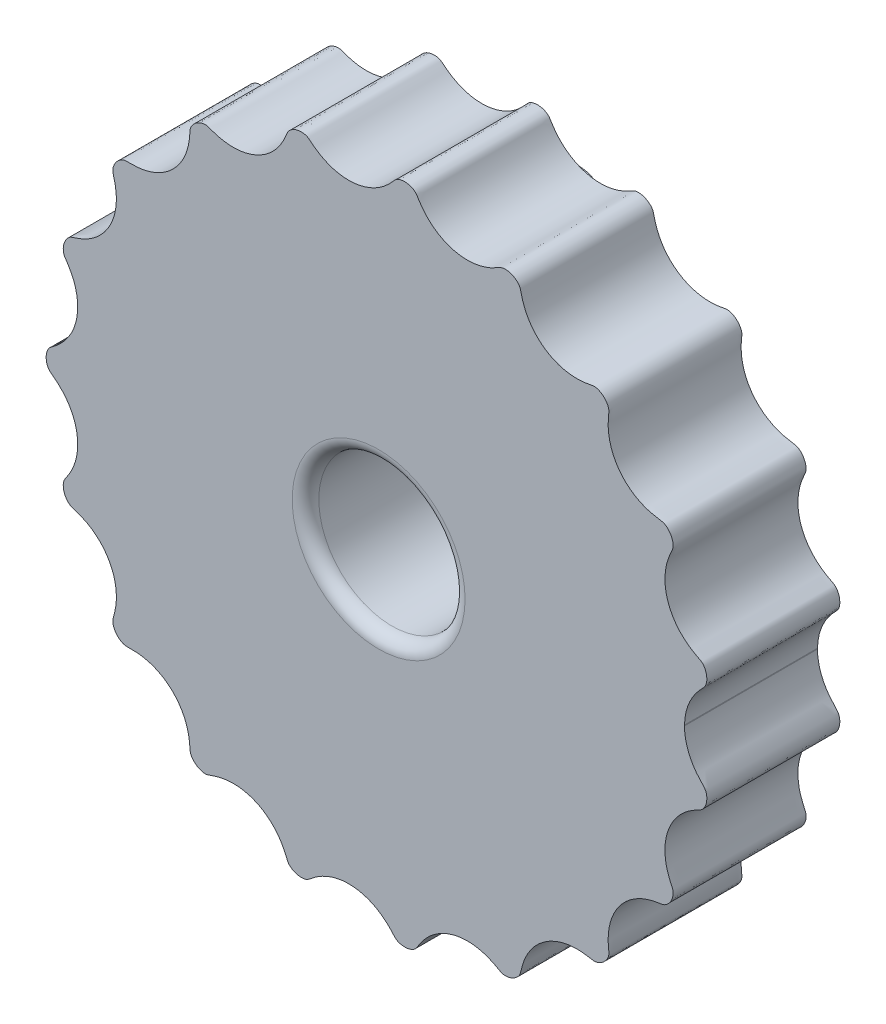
ISO-10303-21;
HEADER;
FILE_DESCRIPTION(('STEP AP214'),'2;1');
FILE_NAME('part.step','',(''),(''),'','','');
FILE_SCHEMA(('AUTOMOTIVE_DESIGN { 1 0 10303 214 1 1 1 1 }'));
ENDSEC;
DATA;
#1=APPLICATION_CONTEXT('core data for automotive mechanical design processes');
#2=APPLICATION_PROTOCOL_DEFINITION('international standard','automotive_design',2000,#1);
#3=PRODUCT_CONTEXT('',#1,'mechanical');
#4=PRODUCT('Part','Part','',(#3));
#5=PRODUCT_RELATED_PRODUCT_CATEGORY('part','',(#4));
#6=PRODUCT_DEFINITION_FORMATION('','',#4);
#7=PRODUCT_DEFINITION_CONTEXT('part definition',#1,'design');
#8=PRODUCT_DEFINITION('design','',#6,#7);
#9=PRODUCT_DEFINITION_SHAPE('','',#8);
#10=(LENGTH_UNIT() NAMED_UNIT(*) SI_UNIT(.MILLI.,.METRE.));
#11=(NAMED_UNIT(*) PLANE_ANGLE_UNIT() SI_UNIT($,.RADIAN.));
#12=(NAMED_UNIT(*) SI_UNIT($,.STERADIAN.) SOLID_ANGLE_UNIT());
#13=UNCERTAINTY_MEASURE_WITH_UNIT(LENGTH_MEASURE(1.E-05),#10,'distance_accuracy_value','');
#14=(GEOMETRIC_REPRESENTATION_CONTEXT(3) GLOBAL_UNCERTAINTY_ASSIGNED_CONTEXT((#13)) GLOBAL_UNIT_ASSIGNED_CONTEXT((#10,
#11,#12)) REPRESENTATION_CONTEXT('',''));
#15=CARTESIAN_POINT('',(0.,0.,0.));
#16=DIRECTION('',(0.,0.,1.));
#17=DIRECTION('',(1.,0.,0.));
#18=AXIS2_PLACEMENT_3D('',#15,#16,#17);
#19=CARTESIAN_POINT('',(0.,0.,0.));
#20=DIRECTION('',(0.,0.,1.));
#21=DIRECTION('',(1.,0.,0.));
#22=AXIS2_PLACEMENT_3D('',#19,#20,#21);
#23=PLANE('',#22);
#24=CARTESIAN_POINT('',(0.,0.,0.));
#25=DIRECTION('',(0.,0.,1.));
#26=DIRECTION('',(1.,0.,0.));
#27=AXIS2_PLACEMENT_3D('',#24,#25,#26);
#28=CIRCLE('',#27,6.5);
#29=CARTESIAN_POINT('',(6.5,0.,0.));
#30=VERTEX_POINT('',#29);
#31=EDGE_CURVE('E52',#30,#30,#28,.T.);
#32=ORIENTED_EDGE('',*,*,#31,.T.);
#33=EDGE_LOOP('',(#32));
#34=FACE_BOUND('',#33,.T.);
#35=CARTESIAN_POINT('',(-12.9903810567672,-7.49999999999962,0.));
#36=DIRECTION('',(0.,0.,1.));
#37=DIRECTION('',(1.,0.,0.));
#38=AXIS2_PLACEMENT_3D('',#35,#36,#37);
#39=CIRCLE('',#38,2.50000000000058);
#40=CARTESIAN_POINT('',(-10.4903810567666,-7.49999999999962,0.));
#41=VERTEX_POINT('',#40);
#42=EDGE_CURVE('E147',#41,#41,#39,.F.);
#43=ORIENTED_EDGE('',*,*,#42,.F.);
#44=EDGE_LOOP('',(#43));
#45=FACE_BOUND('',#44,.T.);
#46=CARTESIAN_POINT('',(12.9903810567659,-7.50000000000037,0.));
#47=DIRECTION('',(0.,0.,1.));
#48=DIRECTION('',(1.,0.,0.));
#49=AXIS2_PLACEMENT_3D('',#46,#47,#48);
#50=CIRCLE('',#49,2.50000000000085);
#51=CARTESIAN_POINT('',(15.4903810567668,-7.50000000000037,0.));
#52=VERTEX_POINT('',#51);
#53=EDGE_CURVE('E152',#52,#52,#50,.F.);
#54=ORIENTED_EDGE('',*,*,#53,.F.);
#55=EDGE_LOOP('',(#54));
#56=FACE_BOUND('',#55,.T.);
#57=CARTESIAN_POINT('',(0.,15.,0.));
#58=DIRECTION('',(0.,0.,1.));
#59=DIRECTION('',(1.,0.,0.));
#60=AXIS2_PLACEMENT_3D('',#57,#58,#59);
#61=CIRCLE('',#60,2.5);
#62=CARTESIAN_POINT('',(2.5,15.,0.));
#63=VERTEX_POINT('',#62);
#64=EDGE_CURVE('E98',#63,#63,#61,.F.);
#65=ORIENTED_EDGE('',*,*,#64,.F.);
#66=EDGE_LOOP('',(#65));
#67=FACE_BOUND('',#66,.T.);
#68=CARTESIAN_POINT('',(23.0004450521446,0.0609374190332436,0.));
#69=CARTESIAN_POINT('',(23.0010644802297,0.103341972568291,0.));
#70=CARTESIAN_POINT('',(23.0038092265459,0.188906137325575,0.));
#71=CARTESIAN_POINT('',(23.0131501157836,0.367843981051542,0.));
#72=CARTESIAN_POINT('',(23.0334981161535,0.534909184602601,0.));
#73=CARTESIAN_POINT('',(23.0705654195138,0.786083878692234,0.));
#74=CARTESIAN_POINT('',(23.1320141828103,1.06083292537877,0.));
#75=CARTESIAN_POINT('',(23.2545603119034,1.4742128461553,0.));
#76=CARTESIAN_POINT('',(23.4419605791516,1.90190498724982,0.));
#77=CARTESIAN_POINT('',(23.6526500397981,2.26726702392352,0.));
#78=CARTESIAN_POINT('',(23.8668861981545,2.5657364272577,0.));
#79=CARTESIAN_POINT('',(24.0252943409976,2.76594758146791,0.));
#80=CARTESIAN_POINT('',(24.1558379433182,2.91651817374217,0.));
#81=CARTESIAN_POINT('',(24.2851186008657,3.05651856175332,0.));
#82=CARTESIAN_POINT('',(24.4048398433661,3.18265204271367,0.));
#83=CARTESIAN_POINT('',(24.4955538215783,3.27862792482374,0.));
#84=CARTESIAN_POINT('',(24.5776413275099,3.3978753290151,0.));
#85=CARTESIAN_POINT('',(24.6403019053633,3.55800179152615,0.));
#86=CARTESIAN_POINT('',(24.6804298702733,3.75861614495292,0.));
#87=CARTESIAN_POINT('',(24.6829995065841,3.99723654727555,0.));
#88=CARTESIAN_POINT('',(24.6407164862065,4.24466441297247,0.));
#89=CARTESIAN_POINT('',(24.5598566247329,4.46599330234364,0.));
#90=CARTESIAN_POINT('',(24.4632988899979,4.62969794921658,0.));
#91=CARTESIAN_POINT('',(24.3700046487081,4.74154404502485,0.));
#92=CARTESIAN_POINT('',(24.2934573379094,4.80789336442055,0.));
#93=CARTESIAN_POINT('',(24.2331727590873,4.84919927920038,0.));
#94=CARTESIAN_POINT('',(24.1436718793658,4.90049686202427,0.));
#95=CARTESIAN_POINT('',(24.0251482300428,4.96086436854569,0.));
#96=CARTESIAN_POINT('',(23.8813705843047,5.03731738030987,0.));
#97=CARTESIAN_POINT('',(23.712869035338,5.13135954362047,0.));
#98=CARTESIAN_POINT('',(23.5008423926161,5.25969202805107,0.));
#99=CARTESIAN_POINT('',(23.2503084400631,5.42998618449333,0.));
#100=CARTESIAN_POINT('',(22.9679235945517,5.6540978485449,0.));
#101=CARTESIAN_POINT('',(22.6665695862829,5.94375033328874,0.));
#102=CARTESIAN_POINT('',(22.3909280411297,6.26615978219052,0.));
#103=CARTESIAN_POINT('',(22.1456648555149,6.6198575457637,0.));
#104=CARTESIAN_POINT('',(21.8865384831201,7.09053710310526,0.));
#105=CARTESIAN_POINT('',(21.6972444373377,7.58461786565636,0.));
#106=CARTESIAN_POINT('',(21.5786507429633,8.08655156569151,0.));
#107=CARTESIAN_POINT('',(21.5272191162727,8.58267339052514,0.));
#108=CARTESIAN_POINT('',(21.5223920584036,8.96260511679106,0.));
#109=CARTESIAN_POINT('',(21.5508966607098,9.33550554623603,0.));
#110=CARTESIAN_POINT('',(21.6103337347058,9.69862880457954,0.));
#111=CARTESIAN_POINT('',(21.6878411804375,10.0086036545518,0.));
#112=CARTESIAN_POINT('',(21.7706113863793,10.2666438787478,0.));
#113=CARTESIAN_POINT('',(21.8498829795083,10.4781783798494,0.));
#114=CARTESIAN_POINT('',(21.919038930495,10.6454192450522,0.));
#115=CARTESIAN_POINT('',(21.9816260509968,10.7867118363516,0.));
#116=CARTESIAN_POINT('',(22.035042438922,10.9030063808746,0.));
#117=CARTESIAN_POINT('',(22.084453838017,11.0131731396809,0.));
#118=CARTESIAN_POINT('',(22.1290439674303,11.1266774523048,0.));
#119=CARTESIAN_POINT('',(22.1489992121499,11.2598240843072,0.));
#120=CARTESIAN_POINT('',(22.1435566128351,11.4053666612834,0.));
#121=CARTESIAN_POINT('',(22.1170450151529,11.5725890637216,0.));
#122=CARTESIAN_POINT('',(22.0633944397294,11.7504492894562,0.));
#123=CARTESIAN_POINT('',(21.9702363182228,11.946885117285,0.));
#124=CARTESIAN_POINT('',(21.8436701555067,12.1238066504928,0.));
#125=CARTESIAN_POINT('',(21.7133767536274,12.2560985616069,0.));
#126=CARTESIAN_POINT('',(21.5962964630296,12.3450186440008,0.));
#127=CARTESIAN_POINT('',(21.5025310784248,12.4008340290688,0.));
#128=CARTESIAN_POINT('',(21.3990220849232,12.4432188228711,0.));
#129=CARTESIAN_POINT('',(21.2868217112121,12.4679022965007,0.));
#130=CARTESIAN_POINT('',(21.130878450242,12.4903115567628,0.));
#131=CARTESIAN_POINT('',(20.953603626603,12.5182372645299,0.));
#132=CARTESIAN_POINT('',(20.7643712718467,12.5521053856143,0.));
#133=CARTESIAN_POINT('',(20.5194912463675,12.605928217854,0.));
#134=CARTESIAN_POINT('',(20.1600221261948,12.7034344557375,0.));
#135=CARTESIAN_POINT('',(19.6713346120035,12.8869653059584,0.));
#136=CARTESIAN_POINT('',(19.0810609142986,13.213737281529,0.));
#137=CARTESIAN_POINT('',(18.4823551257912,13.7066338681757,0.));
#138=CARTESIAN_POINT('',(17.9827894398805,14.3046626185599,0.));
#139=CARTESIAN_POINT('',(17.6070636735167,14.9758213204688,0.));
#140=CARTESIAN_POINT('',(17.3914134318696,15.6061212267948,0.));
#141=CARTESIAN_POINT('',(17.2886005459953,16.1631502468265,0.));
#142=CARTESIAN_POINT('',(17.2593961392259,16.5774164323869,0.));
#143=CARTESIAN_POINT('',(17.2581121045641,16.8499339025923,0.));
#144=CARTESIAN_POINT('',(17.2672347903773,17.070006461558,0.));
#145=CARTESIAN_POINT('',(17.2791263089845,17.2377183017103,0.));
#146=CARTESIAN_POINT('',(17.2934381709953,17.3967835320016,0.));
#147=CARTESIAN_POINT('',(17.3092886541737,17.5470541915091,0.));
#148=CARTESIAN_POINT('',(17.3188500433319,17.7044671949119,0.));
#149=CARTESIAN_POINT('',(17.2904355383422,17.8485405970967,0.));
#150=CARTESIAN_POINT('',(17.2386992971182,17.9815332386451,0.));
#151=CARTESIAN_POINT('',(17.1576230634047,18.1323633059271,0.));
#152=CARTESIAN_POINT('',(17.0476886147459,18.2836398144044,0.));
#153=CARTESIAN_POINT('',(16.8932226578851,18.4399573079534,0.));
#154=CARTESIAN_POINT('',(16.712767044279,18.5662875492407,0.));
#155=CARTESIAN_POINT('',(16.5434032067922,18.6483748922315,0.));
#156=CARTESIAN_POINT('',(16.3919147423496,18.695708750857,0.));
#157=CARTESIAN_POINT('',(16.2633999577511,18.7185500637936,0.));
#158=CARTESIAN_POINT('',(16.1187982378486,18.7114090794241,0.));
#159=CARTESIAN_POINT('',(15.9628511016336,18.6804311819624,0.));
#160=CARTESIAN_POINT('',(15.7955730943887,18.6509993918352,0.));
#161=CARTESIAN_POINT('',(15.6162821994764,18.6220231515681,0.));
#162=CARTESIAN_POINT('',(15.431926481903,18.5982744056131,0.));
#163=CARTESIAN_POINT('',(15.2424369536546,18.5806300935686,0.));
#164=CARTESIAN_POINT('',(14.9983346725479,18.5678165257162,0.));
#165=CARTESIAN_POINT('',(14.6978223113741,18.5692961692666,0.));
#166=CARTESIAN_POINT('',(14.3465623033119,18.5976695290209,0.));
#167=CARTESIAN_POINT('',(13.8413545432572,18.6865447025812,0.));
#168=CARTESIAN_POINT('',(13.3474045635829,18.8414163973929,0.));
#169=CARTESIAN_POINT('',(12.8766615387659,19.0607681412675,0.));
#170=CARTESIAN_POINT('',(12.4404070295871,19.3396979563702,0.));
#171=CARTESIAN_POINT('',(12.1194362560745,19.5923890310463,0.));
#172=CARTESIAN_POINT('',(11.82732244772,19.8724017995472,0.));
#173=CARTESIAN_POINT('',(11.5657738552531,20.1760918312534,0.));
#174=CARTESIAN_POINT('',(11.2824305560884,20.5759636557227,0.));
#175=CARTESIAN_POINT('',(11.074042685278,20.961211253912,0.));
#176=CARTESIAN_POINT('',(10.9260104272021,21.3181212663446,0.));
#177=CARTESIAN_POINT('',(10.8223643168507,21.6364879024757,0.));
#178=CARTESIAN_POINT('',(10.7696450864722,21.8218639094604,0.));
#179=CARTESIAN_POINT('',(10.7283691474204,21.9832781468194,0.));
#180=CARTESIAN_POINT('',(10.6965388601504,22.1195677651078,0.));
#181=CARTESIAN_POINT('',(10.6698067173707,22.2304212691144,0.));
#182=CARTESIAN_POINT('',(10.6459464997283,22.3149341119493,0.));
#183=CARTESIAN_POINT('',(10.6031755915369,22.4212366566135,0.));
#184=CARTESIAN_POINT('',(10.5340769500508,22.5263972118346,0.));
#185=CARTESIAN_POINT('',(10.4440730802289,22.6278247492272,0.));
#186=CARTESIAN_POINT('',(10.3090535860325,22.7454665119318,0.));
#187=CARTESIAN_POINT('',(10.1449197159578,22.8528142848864,0.));
#188=CARTESIAN_POINT('',(9.96573029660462,22.9333716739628,0.));
#189=CARTESIAN_POINT('',(9.77675296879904,22.9846340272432,0.));
#190=CARTESIAN_POINT('',(9.59966398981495,23.008128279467,0.));
#191=CARTESIAN_POINT('',(9.4518387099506,23.0082709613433,0.));
#192=CARTESIAN_POINT('',(9.30082605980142,22.9868990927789,0.));
#193=CARTESIAN_POINT('',(9.14843663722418,22.9195820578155,0.));
#194=CARTESIAN_POINT('',(9.00629573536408,22.8364891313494,0.));
#195=CARTESIAN_POINT('',(8.85136035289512,22.7515834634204,0.));
#196=CARTESIAN_POINT('',(8.68415685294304,22.6633743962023,0.));
#197=CARTESIAN_POINT('',(8.4659469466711,22.557985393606,0.));
#198=CARTESIAN_POINT('',(8.19346563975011,22.442983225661,0.));
#199=CARTESIAN_POINT('',(7.8577537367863,22.3290184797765,0.));
#200=CARTESIAN_POINT('',(7.45596770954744,22.2330420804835,0.));
#201=CARTESIAN_POINT('',(7.03996906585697,22.1755239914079,0.));
#202=CARTESIAN_POINT('',(6.61357111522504,22.1597399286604,0.));
#203=CARTESIAN_POINT('',(6.1032438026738,22.1928478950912,0.));
#204=CARTESIAN_POINT('',(5.60993913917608,22.2896928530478,0.));
#205=CARTESIAN_POINT('',(5.14338857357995,22.4442843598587,0.));
#206=CARTESIAN_POINT('',(4.71453132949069,22.6471757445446,0.));
#207=CARTESIAN_POINT('',(4.39111897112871,22.8375133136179,0.));
#208=CARTESIAN_POINT('',(4.08670751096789,23.0547537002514,0.));
#209=CARTESIAN_POINT('',(3.80304315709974,23.2967196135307,0.));
#210=CARTESIAN_POINT('',(3.54117376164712,23.5622918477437,0.));
#211=CARTESIAN_POINT('',(3.33135134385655,23.8136303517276,0.));
#212=CARTESIAN_POINT('',(3.16729935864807,24.0378234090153,0.));
#213=CARTESIAN_POINT('',(3.05128465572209,24.2110609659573,0.));
#214=CARTESIAN_POINT('',(2.97407854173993,24.3312155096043,0.));
#215=CARTESIAN_POINT('',(2.90893122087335,24.4353210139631,0.));
#216=CARTESIAN_POINT('',(2.8530196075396,24.5220232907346,0.));
#217=CARTESIAN_POINT('',(2.77763239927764,24.6216491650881,0.));
#218=CARTESIAN_POINT('',(2.67867992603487,24.7064419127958,0.));
#219=CARTESIAN_POINT('',(2.56349711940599,24.7759495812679,0.));
#220=CARTESIAN_POINT('',(2.4075865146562,24.8456503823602,0.));
#221=CARTESIAN_POINT('',(2.22835391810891,24.8981764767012,0.));
#222=CARTESIAN_POINT('',(2.01091815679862,24.9274566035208,0.));
#223=CARTESIAN_POINT('',(1.79118975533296,24.9173237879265,0.));
#224=CARTESIAN_POINT('',(1.6073060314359,24.8790281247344,0.));
#225=CARTESIAN_POINT('',(1.4665345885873,24.8274053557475,0.));
#226=CARTESIAN_POINT('',(1.36596425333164,24.7764513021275,0.));
#227=CARTESIAN_POINT('',(1.28490950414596,24.7171219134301,0.));
#228=CARTESIAN_POINT('',(1.22151119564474,24.6555969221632,0.));
#229=CARTESIAN_POINT('',(1.15343854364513,24.5815042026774,0.));
#230=CARTESIAN_POINT('',(1.07877477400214,24.4970564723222,0.));
#231=CARTESIAN_POINT('',(0.990419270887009,24.3996139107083,0.));
#232=CARTESIAN_POINT('',(0.879528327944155,24.2812996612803,0.));
#233=CARTESIAN_POINT('',(0.757233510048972,24.1576265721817,0.));
#234=CARTESIAN_POINT('',(0.586090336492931,23.9963966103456,0.));
#235=CARTESIAN_POINT('',(0.279913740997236,23.7377910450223,0.));
#236=CARTESIAN_POINT('',(-0.185417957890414,23.4210136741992,0.));
#237=CARTESIAN_POINT('',(-0.841139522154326,23.1135331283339,0.));
#238=CARTESIAN_POINT('',(-1.63279965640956,22.9187714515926,0.));
#239=CARTESIAN_POINT('',(-2.42970180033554,22.8811842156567,0.));
#240=CARTESIAN_POINT('',(-3.18969687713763,22.98750840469,0.));
#241=CARTESIAN_POINT('',(-3.80648197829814,23.1882776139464,0.));
#242=CARTESIAN_POINT('',(-4.25792544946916,23.40952083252,0.));
#243=CARTESIAN_POINT('',(-4.56567071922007,23.5972605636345,0.));
#244=CARTESIAN_POINT('',(-4.7458498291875,23.7196194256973,0.));
#245=CARTESIAN_POINT('',(-4.87956659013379,23.8169925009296,0.));
#246=CARTESIAN_POINT('',(-5.00520766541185,23.9132889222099,0.));
#247=CARTESIAN_POINT('',(-5.10839703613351,23.9954562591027,0.));
#248=CARTESIAN_POINT('',(-5.1962832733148,24.0667457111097,0.));
#249=CARTESIAN_POINT('',(-5.27555451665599,24.1275195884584,0.));
#250=CARTESIAN_POINT('',(-5.34752737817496,24.1751925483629,0.));
#251=CARTESIAN_POINT('',(-5.45544706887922,24.226628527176,0.));
#252=CARTESIAN_POINT('',(-5.61332665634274,24.2679019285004,0.));
#253=CARTESIAN_POINT('',(-5.81248805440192,24.2858139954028,0.));
#254=CARTESIAN_POINT('',(-6.04892210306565,24.2634708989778,0.));
#255=CARTESIAN_POINT('',(-6.28478849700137,24.1982333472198,0.));
#256=CARTESIAN_POINT('',(-6.4910822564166,24.0996183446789,0.));
#257=CARTESIAN_POINT('',(-6.6528295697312,23.9826572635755,0.));
#258=CARTESIAN_POINT('',(-6.7731717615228,23.8583116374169,0.));
#259=CARTESIAN_POINT('',(-6.83961553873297,23.7424509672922,0.));
#260=CARTESIAN_POINT('',(-6.88287024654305,23.6417345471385,0.));
#261=CARTESIAN_POINT('',(-6.92897548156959,23.5322327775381,0.));
#262=CARTESIAN_POINT('',(-6.97918741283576,23.4142809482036,0.));
#263=CARTESIAN_POINT('',(-7.04005614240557,23.2775073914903,0.));
#264=CARTESIAN_POINT('',(-7.11617893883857,23.1178274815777,0.));
#265=CARTESIAN_POINT('',(-7.20056760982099,22.9555859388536,0.));
#266=CARTESIAN_POINT('',(-7.3180100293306,22.7492499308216,0.));
#267=CARTESIAN_POINT('',(-7.47816968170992,22.5012513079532,0.));
#268=CARTESIAN_POINT('',(-7.68753153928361,22.2243018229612,0.));
#269=CARTESIAN_POINT('',(-7.95814510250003,21.9275718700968,0.));
#270=CARTESIAN_POINT('',(-8.2599123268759,21.6541948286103,0.));
#271=CARTESIAN_POINT('',(-8.66083173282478,21.3562771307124,0.));
#272=CARTESIAN_POINT('',(-9.18181951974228,21.0633248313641,0.));
#273=CARTESIAN_POINT('',(-9.7353655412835,20.8583848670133,0.));
#274=CARTESIAN_POINT('',(-10.3037773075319,20.7431634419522,0.));
#275=CARTESIAN_POINT('',(-10.7833094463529,20.705631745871,0.));
#276=CARTESIAN_POINT('',(-11.1616253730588,20.7096634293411,0.));
#277=CARTESIAN_POINT('',(-11.5388634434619,20.7468047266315,0.));
#278=CARTESIAN_POINT('',(-11.8655396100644,20.8075028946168,0.));
#279=CARTESIAN_POINT('',(-12.1413237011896,20.878074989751,0.));
#280=CARTESIAN_POINT('',(-12.3518739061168,20.943093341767,0.));
#281=CARTESIAN_POINT('',(-12.5000613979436,20.9929725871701,0.));
#282=CARTESIAN_POINT('',(-12.6314970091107,21.0397639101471,0.));
#283=CARTESIAN_POINT('',(-12.7469137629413,21.0816629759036,0.));
#284=CARTESIAN_POINT('',(-12.8816892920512,21.1275848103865,0.));
#285=CARTESIAN_POINT('',(-13.0232174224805,21.1443617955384,0.));
#286=CARTESIAN_POINT('',(-13.1646854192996,21.131095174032,0.));
#287=CARTESIAN_POINT('',(-13.3350151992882,21.0938854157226,0.));
#288=CARTESIAN_POINT('',(-13.5127331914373,21.0275671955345,0.));
#289=CARTESIAN_POINT('',(-13.70771107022,20.918241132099,0.));
#290=CARTESIAN_POINT('',(-13.8803938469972,20.7741716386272,0.));
#291=CARTESIAN_POINT('',(-14.0059492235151,20.6294351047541,0.));
#292=CARTESIAN_POINT('',(-14.0873372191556,20.5014982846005,0.));
#293=CARTESIAN_POINT('',(-14.1362001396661,20.400514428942,0.));
#294=CARTESIAN_POINT('',(-14.1696652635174,20.2905284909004,0.));
#295=CARTESIAN_POINT('',(-14.1839673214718,20.173300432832,0.));
#296=CARTESIAN_POINT('',(-14.1936306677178,20.0116167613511,0.));
#297=CARTESIAN_POINT('',(-14.207496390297,19.8274109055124,0.));
#298=CARTESIAN_POINT('',(-14.2268591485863,19.6305753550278,0.));
#299=CARTESIAN_POINT('',(-14.26271195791,19.375130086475,0.));
#300=CARTESIAN_POINT('',(-14.3350990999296,18.9985849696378,0.));
#301=CARTESIAN_POINT('',(-14.4878193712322,18.4826931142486,0.));
#302=CARTESIAN_POINT('',(-14.7830279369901,17.8542035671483,0.));
#303=CARTESIAN_POINT('',(-15.2484658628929,17.213007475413,0.));
#304=CARTESIAN_POINT('',(-15.823885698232,16.6734473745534,0.));
#305=CARTESIAN_POINT('',(-16.3973526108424,16.3085128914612,0.));
#306=CARTESIAN_POINT('',(-16.9177749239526,16.0786260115,0.));
#307=CARTESIAN_POINT('',(-17.3647339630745,15.9410111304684,0.));
#308=CARTESIAN_POINT('',(-17.7248018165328,15.8628091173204,0.));
#309=CARTESIAN_POINT('',(-18.0412846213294,15.820863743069,0.));
#310=CARTESIAN_POINT('',(-18.3106294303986,15.802325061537,0.));
#311=CARTESIAN_POINT('',(-18.5320417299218,15.7969443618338,0.));
#312=CARTESIAN_POINT('',(-18.6836276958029,15.7969225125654,0.));
#313=CARTESIAN_POINT('',(-18.8132574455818,15.7990809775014,0.));
#314=CARTESIAN_POINT('',(-18.9269805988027,15.8005385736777,0.));
#315=CARTESIAN_POINT('',(-19.0245949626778,15.7984869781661,0.));
#316=CARTESIAN_POINT('',(-19.1503625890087,15.7793808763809,0.));
#317=CARTESIAN_POINT('',(-19.2786587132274,15.7292741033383,0.));
#318=CARTESIAN_POINT('',(-19.4017458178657,15.6607359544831,0.));
#319=CARTESIAN_POINT('',(-19.5437475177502,15.5557400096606,0.));
#320=CARTESIAN_POINT('',(-19.6794119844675,15.4254489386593,0.));
#321=CARTESIAN_POINT('',(-19.8125272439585,15.252166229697,0.));
#322=CARTESIAN_POINT('',(-19.9195409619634,15.0445062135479,0.));
#323=CARTESIAN_POINT('',(-19.9741862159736,14.8643202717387,0.));
#324=CARTESIAN_POINT('',(-19.993465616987,14.721716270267,0.));
#325=CARTESIAN_POINT('',(-19.9911465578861,14.6219173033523,0.));
#326=CARTESIAN_POINT('',(-19.9814906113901,14.5508659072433,0.));
#327=CARTESIAN_POINT('',(-19.9596359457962,14.4520422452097,0.));
#328=CARTESIAN_POINT('',(-19.9244302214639,14.3263366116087,0.));
#329=CARTESIAN_POINT('',(-19.8839286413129,14.1718166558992,0.));
#330=CARTESIAN_POINT('',(-19.83941825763,13.9878017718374,0.));
#331=CARTESIAN_POINT('',(-19.7902400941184,13.7494276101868,0.));
#332=CARTESIAN_POINT('',(-19.7451420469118,13.4551748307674,0.));
#333=CARTESIAN_POINT('',(-19.7169078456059,13.1023532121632,0.));
#334=CARTESIAN_POINT('',(-19.722218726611,12.6922723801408,0.));
#335=CARTESIAN_POINT('',(-19.7673351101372,12.2788625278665,0.));
#336=CARTESIAN_POINT('',(-19.85423085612,11.8662508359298,0.));
#337=CARTESIAN_POINT('',(-20.0143814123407,11.3636435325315,0.));
#338=CARTESIAN_POINT('',(-20.2770751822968,10.8105198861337,0.));
#339=CARTESIAN_POINT('',(-20.6164390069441,10.3191130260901,0.));
#340=CARTESIAN_POINT('',(-21.0150684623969,9.899172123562,0.));
#341=CARTESIAN_POINT('',(-21.3660194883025,9.60628322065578,0.));
#342=CARTESIAN_POINT('',(-21.6595973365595,9.40050749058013,0.));
#343=CARTESIAN_POINT('',(-21.9661729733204,9.22095812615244,0.));
#344=CARTESIAN_POINT('',(-22.2434766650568,9.08647526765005,0.));
#345=CARTESIAN_POINT('',(-22.487141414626,8.985853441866,0.));
#346=CARTESIAN_POINT('',(-22.6971275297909,8.90966358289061,0.));
#347=CARTESIAN_POINT('',(-22.8484016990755,8.85832288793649,0.));
#348=CARTESIAN_POINT('',(-22.9816290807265,8.81586827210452,0.));
#349=CARTESIAN_POINT('',(-23.0968211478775,8.7757949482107,0.));
#350=CARTESIAN_POINT('',(-23.1870132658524,8.73389595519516,0.));
#351=CARTESIAN_POINT('',(-23.2911900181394,8.66248407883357,0.));
#352=CARTESIAN_POINT('',(-23.4082170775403,8.54904085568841,0.));
#353=CARTESIAN_POINT('',(-23.5263335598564,8.39080511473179,0.));
#354=CARTESIAN_POINT('',(-23.6303183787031,8.18310432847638,0.));
#355=CARTESIAN_POINT('',(-23.6995028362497,7.95346432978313,0.));
#356=CARTESIAN_POINT('',(-23.726069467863,7.73085575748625,0.));
#357=CARTESIAN_POINT('',(-23.7141681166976,7.53088332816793,0.));
#358=CARTESIAN_POINT('',(-23.6712468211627,7.35676687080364,0.));
#359=CARTESIAN_POINT('',(-23.587535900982,7.2107568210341,0.));
#360=CARTESIAN_POINT('',(-23.4888308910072,7.07016675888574,0.));
#361=CARTESIAN_POINT('',(-23.3882676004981,6.91694785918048,0.));
#362=CARTESIAN_POINT('',(-23.2843627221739,6.75241089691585,0.));
#363=CARTESIAN_POINT('',(-23.1587096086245,6.53560145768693,0.));
#364=CARTESIAN_POINT('',(-23.0192784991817,6.26245241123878,0.));
#365=CARTESIAN_POINT('',(-22.877747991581,5.92438993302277,0.));
#366=CARTESIAN_POINT('',(-22.7518654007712,5.51735194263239,0.));
#367=CARTESIAN_POINT('',(-22.6663634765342,5.09510154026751,0.));
#368=CARTESIAN_POINT('',(-22.624177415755,4.66168506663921,0.));
#369=CARTESIAN_POINT('',(-22.6277437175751,4.14416476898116,0.));
#370=CARTESIAN_POINT('',(-22.6969215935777,3.64321925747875,0.));
#371=CARTESIAN_POINT('',(-22.8250601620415,3.16849461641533,0.));
#372=CARTESIAN_POINT('',(-23.0025794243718,2.73028397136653,0.));
#373=CARTESIAN_POINT('',(-23.1734074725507,2.39759943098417,0.));
#374=CARTESIAN_POINT('',(-23.3714935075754,2.08291514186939,0.));
#375=CARTESIAN_POINT('',(-23.5945603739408,1.7879594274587,0.));
#376=CARTESIAN_POINT('',(-23.8110817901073,1.54694379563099,0.));
#377=CARTESIAN_POINT('',(-24.0104853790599,1.35312204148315,0.));
#378=CARTESIAN_POINT('',(-24.1832927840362,1.20112568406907,0.));
#379=CARTESIAN_POINT('',(-24.3242369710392,1.08551778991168,0.));
#380=CARTESIAN_POINT('',(-24.4487192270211,0.988664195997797,0.));
#381=CARTESIAN_POINT('',(-24.5548708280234,0.908952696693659,0.));
#382=CARTESIAN_POINT('',(-24.6411994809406,0.843342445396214,0.));
#383=CARTESIAN_POINT('',(-24.7061246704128,0.790339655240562,0.));
#384=CARTESIAN_POINT('',(-24.7831824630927,0.713841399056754,0.));
#385=CARTESIAN_POINT('',(-24.8504413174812,0.615615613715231,0.));
#386=CARTESIAN_POINT('',(-24.9066420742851,0.500126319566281,0.));
#387=CARTESIAN_POINT('',(-24.9616031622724,0.339906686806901,0.));
#388=CARTESIAN_POINT('',(-24.9980291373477,0.156872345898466,0.));
#389=CARTESIAN_POINT('',(-25.0079752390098,-0.0615272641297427,0.));
#390=CARTESIAN_POINT('',(-24.9788835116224,-0.278375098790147,0.));
#391=CARTESIAN_POINT('',(-24.9250325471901,-0.457300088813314,0.));
#392=CARTESIAN_POINT('',(-24.8613331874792,-0.59323127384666,0.));
#393=CARTESIAN_POINT('',(-24.8008989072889,-0.690159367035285,0.));
#394=CARTESIAN_POINT('',(-24.7323333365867,-0.767244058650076,0.));
#395=CARTESIAN_POINT('',(-24.6619915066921,-0.827034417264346,0.));
#396=CARTESIAN_POINT('',(-24.5779706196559,-0.89154104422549,0.));
#397=CARTESIAN_POINT('',(-24.482308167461,-0.963016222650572,0.));
#398=CARTESIAN_POINT('',(-24.3719847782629,-1.04823760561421,0.));
#399=CARTESIAN_POINT('',(-24.2390268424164,-1.15462412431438,0.));
#400=CARTESIAN_POINT('',(-24.1011027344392,-1.27221831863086,0.));
#401=CARTESIAN_POINT('',(-23.9221175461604,-1.43660713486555,0.));
#402=CARTESIAN_POINT('',(-23.6362767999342,-1.73077995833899,0.));
#403=CARTESIAN_POINT('',(-23.281762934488,-2.1835918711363,0.));
#404=CARTESIAN_POINT('',(-22.9271870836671,-2.83084957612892,0.));
#405=CARTESIAN_POINT('',(-22.6825732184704,-3.62085086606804,0.));
#406=CARTESIAN_POINT('',(-22.599242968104,-4.42206812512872,0.));
#407=CARTESIAN_POINT('',(-22.6560153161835,-5.10075585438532,0.));
#408=CARTESIAN_POINT('',(-22.7839328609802,-5.64508269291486,0.));
#409=CARTESIAN_POINT('',(-22.9383125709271,-6.07567291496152,0.));
#410=CARTESIAN_POINT('',(-23.0687206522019,-6.36331346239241,0.));
#411=CARTESIAN_POINT('',(-23.1954045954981,-6.60097575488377,0.));
#412=CARTESIAN_POINT('',(-23.3169904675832,-6.80553099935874,0.));
#413=CARTESIAN_POINT('',(-23.4134801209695,-6.95589523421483,0.));
#414=CARTESIAN_POINT('',(-23.5046446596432,-7.09189883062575,0.));
#415=CARTESIAN_POINT('',(-23.5869866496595,-7.21312038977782,0.));
#416=CARTESIAN_POINT('',(-23.6458842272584,-7.31129955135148,0.));
#417=CARTESIAN_POINT('',(-23.6936359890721,-7.43717701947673,0.));
#418=CARTESIAN_POINT('',(-23.7216283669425,-7.60152763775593,0.));
#419=CARTESIAN_POINT('',(-23.7223084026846,-7.80201130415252,0.));
#420=CARTESIAN_POINT('',(-23.6806344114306,-8.03349246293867,0.));
#421=CARTESIAN_POINT('',(-23.59593129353,-8.26306779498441,0.));
#422=CARTESIAN_POINT('',(-23.4800063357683,-8.4610170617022,0.));
#423=CARTESIAN_POINT('',(-23.3487704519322,-8.61326074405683,0.));
#424=CARTESIAN_POINT('',(-23.2127158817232,-8.7238612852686,0.));
#425=CARTESIAN_POINT('',(-23.0663566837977,-8.78968521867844,0.));
#426=CARTESIAN_POINT('',(-22.9125310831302,-8.83693719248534,0.));
#427=CARTESIAN_POINT('',(-22.748877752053,-8.89193738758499,0.));
#428=CARTESIAN_POINT('',(-22.5744954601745,-8.95337392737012,0.));
#429=CARTESIAN_POINT('',(-22.3540791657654,-9.03952140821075,0.));
#430=CARTESIAN_POINT('',(-22.0907560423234,-9.15759161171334,0.));
#431=CARTESIAN_POINT('',(-21.7859013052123,-9.3207230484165,0.));
#432=CARTESIAN_POINT('',(-21.4493417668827,-9.54194913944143,0.));
#433=CARTESIAN_POINT('',(-21.1295614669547,-9.79839843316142,0.));
#434=CARTESIAN_POINT('',(-20.8313398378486,-10.0897970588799,0.));
#435=CARTESIAN_POINT('',(-20.5060815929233,-10.4778880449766,0.));
#436=CARTESIAN_POINT('',(-20.2354524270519,-10.9007400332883,0.));
#437=CARTESIAN_POINT('',(-20.0234952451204,-11.3478403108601,0.));
#438=CARTESIAN_POINT('',(-19.8724944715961,-11.8050881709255,0.));
#439=CARTESIAN_POINT('',(-19.786480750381,-12.1771034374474,0.));
#440=CARTESIAN_POINT('',(-19.7342884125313,-12.5535769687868,0.));
#441=CARTESIAN_POINT('',(-19.7154994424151,-12.9315657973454,0.));
#442=CARTESIAN_POINT('',(-19.7297872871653,-13.3095414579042,0.));
#443=CARTESIAN_POINT('',(-19.7703384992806,-13.6387799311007,0.));
#444=CARTESIAN_POINT('',(-19.822738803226,-13.9153600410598,0.));
#445=CARTESIAN_POINT('',(-19.8775380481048,-14.1470425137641,0.));
#446=CARTESIAN_POINT('',(-19.9208953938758,-14.3131728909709,0.));
#447=CARTESIAN_POINT('',(-19.9621623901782,-14.4593821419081,0.));
#448=CARTESIAN_POINT('',(-19.9940619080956,-14.6091198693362,0.));
#449=CARTESIAN_POINT('',(-19.9941902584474,-14.7408999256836,0.));
#450=CARTESIAN_POINT('',(-19.9694030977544,-14.8748164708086,0.));
#451=CARTESIAN_POINT('',(-19.9174563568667,-15.0391698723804,0.));
#452=CARTESIAN_POINT('',(-19.8355386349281,-15.2103657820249,0.));
#453=CARTESIAN_POINT('',(-19.7097922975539,-15.394155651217,0.));
#454=CARTESIAN_POINT('',(-19.5524111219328,-15.5524234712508,0.));
#455=CARTESIAN_POINT('',(-19.3980896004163,-15.66434186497,0.));
#456=CARTESIAN_POINT('',(-19.2638687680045,-15.7341888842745,0.));
#457=CARTESIAN_POINT('',(-19.1585412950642,-15.7741625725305,0.));
#458=CARTESIAN_POINT('',(-19.0429650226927,-15.7980324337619,0.));
#459=CARTESIAN_POINT('',(-18.9192143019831,-15.8013130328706,0.));
#460=CARTESIAN_POINT('',(-18.7472333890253,-15.7970987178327,0.));
#461=CARTESIAN_POINT('',(-18.5515487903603,-15.7964119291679,0.));
#462=CARTESIAN_POINT('',(-18.3443653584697,-15.8008032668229,0.));
#463=CARTESIAN_POINT('',(-18.0778543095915,-15.8186981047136,0.));
#464=CARTESIAN_POINT('',(-17.6884272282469,-15.865276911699,0.));
#465=CARTESIAN_POINT('',(-17.1511717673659,-15.9855809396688,0.));
#466=CARTESIAN_POINT('',(-16.491481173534,-16.2456853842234,0.));
#467=CARTESIAN_POINT('',(-15.8123440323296,-16.6796683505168,0.));
#468=CARTESIAN_POINT('',(-15.2347483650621,-17.2299118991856,0.));
#469=CARTESIAN_POINT('',(-14.7820895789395,-17.8614300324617,0.));
#470=CARTESIAN_POINT('',(-14.4987938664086,-18.4602384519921,0.));
#471=CARTESIAN_POINT('',(-14.3484234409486,-18.9506966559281,0.));
#472=CARTESIAN_POINT('',(-14.2744379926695,-19.3095687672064,0.));
#473=CARTESIAN_POINT('',(-14.2356753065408,-19.5599770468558,0.));
#474=CARTESIAN_POINT('',(-14.2135300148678,-19.7574429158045,0.));
#475=CARTESIAN_POINT('',(-14.1984406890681,-19.9464050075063,0.));
#476=CARTESIAN_POINT('',(-14.1869135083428,-20.1194013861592,0.));
#477=CARTESIAN_POINT('',(-14.1772264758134,-20.2506342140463,0.));
#478=CARTESIAN_POINT('',(-14.1432637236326,-20.3907384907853,0.));
#479=CARTESIAN_POINT('',(-14.0670190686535,-20.5439346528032,0.));
#480=CARTESIAN_POINT('',(-13.9463238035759,-20.7079390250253,0.));
#481=CARTESIAN_POINT('',(-13.7726838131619,-20.8699590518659,0.));
#482=CARTESIAN_POINT('',(-13.5626064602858,-21.0051884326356,0.));
#483=CARTESIAN_POINT('',(-13.3458445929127,-21.0946672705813,0.));
#484=CARTESIAN_POINT('',(-13.1606618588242,-21.1340559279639,0.));
#485=CARTESIAN_POINT('',(-13.0154934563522,-21.1409328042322,0.));
#486=CARTESIAN_POINT('',(-12.9147776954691,-21.1293423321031,0.));
#487=CARTESIAN_POINT('',(-12.8431971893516,-21.1126992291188,0.));
#488=CARTESIAN_POINT('',(-12.7443393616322,-21.0812522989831,0.));
#489=CARTESIAN_POINT('',(-12.618960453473,-21.0346928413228,0.));
#490=CARTESIAN_POINT('',(-12.4644514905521,-20.9804324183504,0.));
#491=CARTESIAN_POINT('',(-12.2800722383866,-20.9199483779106,0.));
#492=CARTESIAN_POINT('',(-12.0407156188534,-20.8507689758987,0.));
#493=CARTESIAN_POINT('',(-11.7441360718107,-20.7818718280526,0.));
#494=CARTESIAN_POINT('',(-11.3859714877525,-20.7263071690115,0.));
#495=CARTESIAN_POINT('',(-10.9663821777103,-20.7016950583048,0.));
#496=CARTESIAN_POINT('',(-10.5400901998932,-20.718700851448,0.));
#497=CARTESIAN_POINT('',(-10.0057507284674,-20.7948541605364,0.));
#498=CARTESIAN_POINT('',(-9.48522843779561,-20.9439687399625,0.));
#499=CARTESIAN_POINT('',(-8.9999733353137,-21.1593640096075,0.));
#500=CARTESIAN_POINT('',(-8.56103981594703,-21.4293105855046,0.));
#501=CARTESIAN_POINT('',(-8.24840665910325,-21.665143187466,0.));
#502=CARTESIAN_POINT('',(-7.96834487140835,-21.9190171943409,0.));
#503=CARTESIAN_POINT('',(-7.71592832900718,-22.1921854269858,0.));
#504=CARTESIAN_POINT('',(-7.49148796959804,-22.4810340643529,0.));
#505=CARTESIAN_POINT('',(-7.31777393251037,-22.7471219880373,0.));
#506=CARTESIAN_POINT('',(-7.18529345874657,-22.9819952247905,0.));
#507=CARTESIAN_POINT('',(-7.0842516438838,-23.1830190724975,0.));
#508=CARTESIAN_POINT('',(-7.00856178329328,-23.3468667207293,0.));
#509=CARTESIAN_POINT('',(-6.94736540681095,-23.4881641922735,0.));
#510=CARTESIAN_POINT('',(-6.89842040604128,-23.6057776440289,0.));
#511=CARTESIAN_POINT('',(-6.85077043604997,-23.7158356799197,0.));
#512=CARTESIAN_POINT('',(-6.79658298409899,-23.8241479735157,0.));
#513=CARTESIAN_POINT('',(-6.71118125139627,-23.9271512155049,0.));
#514=CARTESIAN_POINT('',(-6.6006094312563,-24.0204484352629,0.));
#515=CARTESIAN_POINT('',(-6.45971156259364,-24.1129130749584,0.));
#516=CARTESIAN_POINT('',(-6.29313141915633,-24.1927464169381,0.));
#517=CARTESIAN_POINT('',(-6.08637470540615,-24.2561989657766,0.));
#518=CARTESIAN_POINT('',(-5.87153847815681,-24.2822335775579,0.));
#519=CARTESIAN_POINT('',(-5.68693790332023,-24.2756373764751,0.));
#520=CARTESIAN_POINT('',(-5.5427537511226,-24.2496031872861,0.));
#521=CARTESIAN_POINT('',(-5.43826830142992,-24.2182745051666,0.));
#522=CARTESIAN_POINT('',(-5.33678403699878,-24.1704369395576,0.));
#523=CARTESIAN_POINT('',(-5.24222400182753,-24.1039090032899,0.));
#524=CARTESIAN_POINT('',(-5.1193477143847,-24.0036919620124,0.));
#525=CARTESIAN_POINT('',(-4.97774686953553,-23.8914820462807,0.));
#526=CARTESIAN_POINT('',(-4.8235593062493,-23.7745521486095,0.));
#527=CARTESIAN_POINT('',(-4.61656485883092,-23.6301676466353,0.));
#528=CARTESIAN_POINT('',(-4.29889720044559,-23.4309620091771,0.));
#529=CARTESIAN_POINT('',(-3.82902320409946,-23.1952819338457,0.));
#530=CARTESIAN_POINT('',(-3.18377275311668,-22.9832848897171,0.));
#531=CARTESIAN_POINT('',(-2.41193691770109,-22.8800329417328,0.));
#532=CARTESIAN_POINT('',(-1.63302094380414,-22.921923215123,0.));
#533=CARTESIAN_POINT('',(-0.887269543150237,-23.1037030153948,0.));
#534=CARTESIAN_POINT('',(-0.281567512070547,-23.3733905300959,0.));
#535=CARTESIAN_POINT('',(0.194350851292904,-23.6752129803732,0.));
#536=CARTESIAN_POINT('',(0.51661852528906,-23.9340260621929,0.));
#537=CARTESIAN_POINT('',(0.71665654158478,-24.1173384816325,0.));
#538=CARTESIAN_POINT('',(0.871449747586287,-24.272798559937,0.));
#539=CARTESIAN_POINT('',(0.986207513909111,-24.3949086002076,0.));
#540=CARTESIAN_POINT('',(1.0929201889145,-24.5126035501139,0.));
#541=CARTESIAN_POINT('',(1.19190515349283,-24.625420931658,0.));
#542=CARTESIAN_POINT('',(1.30175329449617,-24.7374351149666,0.));
#543=CARTESIAN_POINT('',(1.42719632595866,-24.8122529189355,0.));
#544=CARTESIAN_POINT('',(1.55973942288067,-24.8633726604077,0.));
#545=CARTESIAN_POINT('',(1.72543451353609,-24.9048794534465,0.));
#546=CARTESIAN_POINT('',(1.91039113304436,-24.9256576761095,0.));
#547=CARTESIAN_POINT('',(2.12896751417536,-24.9172121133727,0.));
#548=CARTESIAN_POINT('',(2.34307020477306,-24.8697627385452,0.));
#549=CARTESIAN_POINT('',(2.51716990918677,-24.8007028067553,0.));
#550=CARTESIAN_POINT('',(2.65427971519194,-24.7214006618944,0.));
#551=CARTESIAN_POINT('',(2.74416188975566,-24.6523005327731,0.));
#552=CARTESIAN_POINT('',(2.8107409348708,-24.5787971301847,0.));
#553=CARTESIAN_POINT('',(2.87712116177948,-24.4860368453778,0.));
#554=CARTESIAN_POINT('',(2.94337025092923,-24.3793613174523,0.));
#555=CARTESIAN_POINT('',(3.02603718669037,-24.2496052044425,0.));
#556=CARTESIAN_POINT('',(3.12701413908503,-24.0973984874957,0.));
#557=CARTESIAN_POINT('',(3.26398205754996,-23.904047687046,0.));
#558=CARTESIAN_POINT('',(3.4440513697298,-23.674800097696,0.));
#559=CARTESIAN_POINT('',(3.67772189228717,-23.4168202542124,0.));
#560=CARTESIAN_POINT('',(3.97550664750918,-23.1429338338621,0.));
#561=CARTESIAN_POINT('',(4.30226720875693,-22.8948310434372,0.));
#562=CARTESIAN_POINT('',(4.65651825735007,-22.6766608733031,0.));
#563=CARTESIAN_POINT('',(5.03202722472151,-22.4940848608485,0.));
#564=CARTESIAN_POINT('',(5.42531107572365,-22.3495600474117,0.));
#565=CARTESIAN_POINT('',(5.82601540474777,-22.2462818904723,0.));
#566=CARTESIAN_POINT('',(6.22978333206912,-22.1835933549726,0.));
#567=CARTESIAN_POINT('',(6.63282472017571,-22.1606595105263,0.));
#568=CARTESIAN_POINT('',(7.03133133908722,-22.1758984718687,0.));
#569=CARTESIAN_POINT('',(7.5145815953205,-22.2401734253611,0.));
#570=CARTESIAN_POINT('',(7.93642325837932,-22.3488061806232,0.));
#571=CARTESIAN_POINT('',(8.29689005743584,-22.4820755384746,0.));
#572=CARTESIAN_POINT('',(8.59939412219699,-22.6214240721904,0.));
#573=CARTESIAN_POINT('',(8.77040029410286,-22.7081631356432,0.));
#574=CARTESIAN_POINT('',(8.91633144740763,-22.7867434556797,0.));
#575=CARTESIAN_POINT('',(9.03741235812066,-22.855573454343,0.));
#576=CARTESIAN_POINT('',(9.13671249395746,-22.9105040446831,0.));
#577=CARTESIAN_POINT('',(9.21498400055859,-22.9493669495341,0.));
#578=CARTESIAN_POINT('',(9.32221861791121,-22.9883278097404,0.));
#579=CARTESIAN_POINT('',(9.44603735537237,-23.0073670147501,0.));
#580=CARTESIAN_POINT('',(9.58099088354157,-23.0090433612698,0.));
#581=CARTESIAN_POINT('',(9.75806508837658,-22.988506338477,0.));
#582=CARTESIAN_POINT('',(9.94704029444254,-22.9399571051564,0.));
#583=CARTESIAN_POINT('',(10.1264812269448,-22.8624917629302,0.));
#584=CARTESIAN_POINT('',(10.2911124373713,-22.7583270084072,0.));
#585=CARTESIAN_POINT('',(10.427360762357,-22.6442356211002,0.));
#586=CARTESIAN_POINT('',(10.5273388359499,-22.5356880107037,0.));
#587=CARTESIAN_POINT('',(10.6134828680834,-22.4097529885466,0.));
#588=CARTESIAN_POINT('',(10.6596414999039,-22.2740877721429,0.));
#589=CARTESIAN_POINT('',(10.6867141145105,-22.1589844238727,0.));
#590=CARTESIAN_POINT('',(10.7169917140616,-22.0322284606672,0.));
#591=CARTESIAN_POINT('',(10.7510613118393,-21.8937068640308,0.));
#592=CARTESIAN_POINT('',(10.7940703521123,-21.7328912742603,0.));
#593=CARTESIAN_POINT('',(10.864967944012,-21.499403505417,0.));
#594=CARTESIAN_POINT('',(10.9662014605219,-21.2192268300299,0.));
#595=CARTESIAN_POINT('',(11.1115290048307,-20.8929846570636,0.));
#596=CARTESIAN_POINT('',(11.3157466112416,-20.5303408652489,0.));
#597=CARTESIAN_POINT('',(11.5582577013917,-20.1838253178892,0.));
#598=CARTESIAN_POINT('',(11.8388764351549,-19.8585541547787,0.));
#599=CARTESIAN_POINT('',(12.2149007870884,-19.5036466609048,0.));
#600=CARTESIAN_POINT('',(12.6278235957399,-19.2051943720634,0.));
#601=CARTESIAN_POINT('',(13.0666135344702,-18.9667198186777,0.));
#602=CARTESIAN_POINT('',(13.6042585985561,-18.7559343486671,0.));
#603=CARTESIAN_POINT('',(14.0692576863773,-18.6360894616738,0.));
#604=CARTESIAN_POINT('',(14.5428827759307,-18.5729420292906,0.));
#605=CARTESIAN_POINT('',(14.9675720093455,-18.5655428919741,0.));
#606=CARTESIAN_POINT('',(15.2504924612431,-18.5802384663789,0.));
#607=CARTESIAN_POINT('',(15.4825468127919,-18.604172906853,0.));
#608=CARTESIAN_POINT('',(15.6640125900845,-18.6292353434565,0.));
#609=CARTESIAN_POINT('',(15.8370194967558,-18.6581487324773,0.));
#610=CARTESIAN_POINT('',(15.9826504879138,-18.6847435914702,0.));
#611=CARTESIAN_POINT('',(16.1023977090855,-18.706443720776,0.));
#612=CARTESIAN_POINT('',(16.2280108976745,-18.7182563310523,0.));
#613=CARTESIAN_POINT('',(16.3771478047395,-18.7041419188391,0.));
#614=CARTESIAN_POINT('',(16.5632562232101,-18.6445492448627,0.));
#615=CARTESIAN_POINT('',(16.7740949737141,-18.5305599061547,0.));
#616=CARTESIAN_POINT('',(16.9705535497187,-18.3697487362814,0.));
#617=CARTESIAN_POINT('',(17.1156848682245,-18.199184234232,0.));
#618=CARTESIAN_POINT('',(17.2143314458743,-18.0351978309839,0.));
#619=CARTESIAN_POINT('',(17.2727649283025,-17.8946372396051,0.));
#620=CARTESIAN_POINT('',(17.3037318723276,-17.7847962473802,0.));
#621=CARTESIAN_POINT('',(17.3148273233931,-17.6840329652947,0.));
#622=CARTESIAN_POINT('',(17.3122646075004,-17.5951988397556,0.));
#623=CARTESIAN_POINT('',(17.3037014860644,-17.4943537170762,0.));
#624=CARTESIAN_POINT('',(17.2921036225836,-17.3815702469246,0.));
#625=CARTESIAN_POINT('',(17.280219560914,-17.2497902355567,0.));
#626=CARTESIAN_POINT('',(17.2683122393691,-17.0870968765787,0.));
#627=CARTESIAN_POINT('',(17.2602891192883,-16.9122976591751,0.));
#628=CARTESIAN_POINT('',(17.2578853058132,-16.6757336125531,0.));
#629=CARTESIAN_POINT('',(17.2758393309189,-16.2728043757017,0.));
#630=CARTESIAN_POINT('',(17.359944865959,-15.7124856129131,0.));
#631=CARTESIAN_POINT('',(17.5817910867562,-15.0183617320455,0.));
#632=CARTESIAN_POINT('',(17.9797687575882,-14.3032683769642,0.));
#633=CARTESIAN_POINT('',(18.4956817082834,-13.6938636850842,0.));
#634=CARTESIAN_POINT('',(19.0899063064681,-13.2109457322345,0.));
#635=CARTESIAN_POINT('',(19.6539013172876,-12.8972028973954,0.));
#636=CARTESIAN_POINT('',(20.1205212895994,-12.717519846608,0.));
#637=CARTESIAN_POINT('',(20.4655154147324,-12.6197619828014,0.));
#638=CARTESIAN_POINT('',(20.6763485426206,-12.5708514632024,0.));
#639=CARTESIAN_POINT('',(20.8374280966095,-12.5390264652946,0.));
#640=CARTESIAN_POINT('',(20.9920619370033,-12.5121352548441,0.));
#641=CARTESIAN_POINT('',(21.1211856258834,-12.4922288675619,0.));
#642=CARTESIAN_POINT('',(21.2321094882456,-12.4760522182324,0.));
#643=CARTESIAN_POINT('',(21.3300647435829,-12.458579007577,0.));
#644=CARTESIAN_POINT('',(21.4140328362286,-12.4372104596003,0.));
#645=CARTESIAN_POINT('',(21.5247139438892,-12.3913799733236,0.));
#646=CARTESIAN_POINT('',(21.6614059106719,-12.3022033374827,0.));
#647=CARTESIAN_POINT('',(21.8082944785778,-12.1674181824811,0.));
#648=CARTESIAN_POINT('',(21.9505041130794,-11.9787709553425,0.));
#649=CARTESIAN_POINT('',(22.0610147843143,-11.7618587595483,0.));
#650=CARTESIAN_POINT('',(22.1274252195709,-11.5442221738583,0.));
#651=CARTESIAN_POINT('',(22.1504063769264,-11.34681753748,0.));
#652=CARTESIAN_POINT('',(22.1403982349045,-11.17455368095,0.));
#653=CARTESIAN_POINT('',(22.0924228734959,-11.0248200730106,0.));
#654=CARTESIAN_POINT('',(22.0247833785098,-10.8828874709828,0.));
#655=CARTESIAN_POINT('',(21.9558272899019,-10.7290222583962,0.));
#656=CARTESIAN_POINT('',(21.8842052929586,-10.5631578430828,0.));
#657=CARTESIAN_POINT('',(21.7994544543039,-10.3482745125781,0.));
#658=CARTESIAN_POINT('',(21.7086883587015,-10.081815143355,0.));
#659=CARTESIAN_POINT('',(21.6217715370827,-9.75610453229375,0.));
#660=CARTESIAN_POINT('',(21.5541250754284,-9.36939932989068,0.));
#661=CARTESIAN_POINT('',(21.5216048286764,-8.97076473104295,0.));
#662=CARTESIAN_POINT('',(21.5273163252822,-8.56355107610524,0.));
#663=CARTESIAN_POINT('',(21.5828839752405,-8.06531043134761,0.));
#664=CARTESIAN_POINT('',(21.7248972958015,-7.48110768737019,0.));
#665=CARTESIAN_POINT('',(21.9547923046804,-6.93318939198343,0.));
#666=CARTESIAN_POINT('',(22.2616971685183,-6.43606056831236,0.));
#667=CARTESIAN_POINT('',(22.5655498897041,-6.05690308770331,0.));
#668=CARTESIAN_POINT('',(22.8316176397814,-5.7798902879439,0.));
#669=CARTESIAN_POINT('',(23.1211907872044,-5.52761435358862,0.));
#670=CARTESIAN_POINT('',(23.3932959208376,-5.32917922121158,0.));
#671=CARTESIAN_POINT('',(23.6352238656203,-5.17617829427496,0.));
#672=CARTESIAN_POINT('',(23.8460284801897,-5.05645774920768,0.));
#673=CARTESIAN_POINT('',(24.0000972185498,-4.9739569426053,0.));
#674=CARTESIAN_POINT('',(24.1376792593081,-4.90387031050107,0.));
#675=CARTESIAN_POINT('',(24.2515713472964,-4.83947250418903,0.));
#676=CARTESIAN_POINT('',(24.331050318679,-4.77842553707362,0.));
#677=CARTESIAN_POINT('',(24.4036726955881,-4.70241877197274,0.));
#678=CARTESIAN_POINT('',(24.4694514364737,-4.61437688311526,0.));
#679=CARTESIAN_POINT('',(24.5464457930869,-4.48477708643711,0.));
#680=CARTESIAN_POINT('',(24.6205203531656,-4.30681524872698,0.));
#681=CARTESIAN_POINT('',(24.6734549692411,-4.08694513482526,0.));
#682=CARTESIAN_POINT('',(24.6852126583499,-3.86090538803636,0.));
#683=CARTESIAN_POINT('',(24.6638332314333,-3.66862320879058,0.));
#684=CARTESIAN_POINT('',(24.6245755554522,-3.52082964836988,0.));
#685=CARTESIAN_POINT('',(24.5829501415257,-3.41560666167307,0.));
#686=CARTESIAN_POINT('',(24.5240227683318,-3.31591828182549,0.));
#687=CARTESIAN_POINT('',(24.4467365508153,-3.22563530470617,0.));
#688=CARTESIAN_POINT('',(24.333633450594,-3.10835817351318,0.));
#689=CARTESIAN_POINT('',(24.2067271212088,-2.97226733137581,0.));
#690=CARTESIAN_POINT('',(24.0743122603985,-2.82411025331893,0.));
#691=CARTESIAN_POINT('',(23.9098705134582,-2.62244551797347,0.));
#692=CARTESIAN_POINT('',(23.6809140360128,-2.31321832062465,0.));
#693=CARTESIAN_POINT('',(23.4558532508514,-1.93179938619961,0.));
#694=CARTESIAN_POINT('',(23.2566016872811,-1.48398570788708,0.));
#695=CARTESIAN_POINT('',(23.1283446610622,-1.04828118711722,0.));
#696=CARTESIAN_POINT('',(23.0651900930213,-0.760458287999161,0.));
#697=CARTESIAN_POINT('',(23.0285746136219,-0.495064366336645,0.));
#698=CARTESIAN_POINT('',(23.0089901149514,-0.322210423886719,0.));
#699=CARTESIAN_POINT('',(23.0016345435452,-0.133544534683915,0.));
#700=CARTESIAN_POINT('',(23.,-0.0443490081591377,0.));
#701=CARTESIAN_POINT('',(23.,0.,0.));
#702=B_SPLINE_CURVE_WITH_KNOTS('',4,(#68,#69,#70,#71,#72,#73,#74,#75,#76,#77,#78,#79,#80,#81,
#82,#83,#84,#85,#86,#87,#88,#89,#90,#91,#92,#93,#94,#95,#96,#97,#98,#99,#100,#101,#102,#103,
#104,#105,#106,#107,#108,#109,#110,#111,#112,#113,#114,#115,#116,#117,#118,#119,#120,#121,#122,
#123,#124,#125,#126,#127,#128,#129,#130,#131,#132,#133,#134,#135,#136,#137,#138,#139,#140,#141,
#142,#143,#144,#145,#146,#147,#148,#149,#150,#151,#152,#153,#154,#155,#156,#157,#158,#159,#160,
#161,#162,#163,#164,#165,#166,#167,#168,#169,#170,#171,#172,#173,#174,#175,#176,#177,#178,#179,
#180,#181,#182,#183,#184,#185,#186,#187,#188,#189,#190,#191,#192,#193,#194,#195,#196,#197,#198,
#199,#200,#201,#202,#203,#204,#205,#206,#207,#208,#209,#210,#211,#212,#213,#214,#215,#216,#217,
#218,#219,#220,#221,#222,#223,#224,#225,#226,#227,#228,#229,#230,#231,#232,#233,#234,#235,#236,
#237,#238,#239,#240,#241,#242,#243,#244,#245,#246,#247,#248,#249,#250,#251,#252,#253,#254,#255,
#256,#257,#258,#259,#260,#261,#262,#263,#264,#265,#266,#267,#268,#269,#270,#271,#272,#273,#274,
#275,#276,#277,#278,#279,#280,#281,#282,#283,#284,#285,#286,#287,#288,#289,#290,#291,#292,#293,
#294,#295,#296,#297,#298,#299,#300,#301,#302,#303,#304,#305,#306,#307,#308,#309,#310,#311,#312,
#313,#314,#315,#316,#317,#318,#319,#320,#321,#322,#323,#324,#325,#326,#327,#328,#329,#330,#331,
#332,#333,#334,#335,#336,#337,#338,#339,#340,#341,#342,#343,#344,#345,#346,#347,#348,#349,#350,
#351,#352,#353,#354,#355,#356,#357,#358,#359,#360,#361,#362,#363,#364,#365,#366,#367,#368,#369,
#370,#371,#372,#373,#374,#375,#376,#377,#378,#379,#380,#381,#382,#383,#384,#385,#386,#387,#388,
#389,#390,#391,#392,#393,#394,#395,#396,#397,#398,#399,#400,#401,#402,#403,#404,#405,#406,#407,
#408,#409,#410,#411,#412,#413,#414,#415,#416,#417,#418,#419,#420,#421,#422,#423,#424,#425,#426,
#427,#428,#429,#430,#431,#432,#433,#434,#435,#436,#437,#438,#439,#440,#441,#442,#443,#444,#445,
#446,#447,#448,#449,#450,#451,#452,#453,#454,#455,#456,#457,#458,#459,#460,#461,#462,#463,#464,
#465,#466,#467,#468,#469,#470,#471,#472,#473,#474,#475,#476,#477,#478,#479,#480,#481,#482,#483,
#484,#485,#486,#487,#488,#489,#490,#491,#492,#493,#494,#495,#496,#497,#498,#499,#500,#501,#502,
#503,#504,#505,#506,#507,#508,#509,#510,#511,#512,#513,#514,#515,#516,#517,#518,#519,#520,#521,
#522,#523,#524,#525,#526,#527,#528,#529,#530,#531,#532,#533,#534,#535,#536,#537,#538,#539,#540,
#541,#542,#543,#544,#545,#546,#547,#548,#549,#550,#551,#552,#553,#554,#555,#556,#557,#558,#559,
#560,#561,#562,#563,#564,#565,#566,#567,#568,#569,#570,#571,#572,#573,#574,#575,#576,#577,#578,
#579,#580,#581,#582,#583,#584,#585,#586,#587,#588,#589,#590,#591,#592,#593,#594,#595,#596,#597,
#598,#599,#600,#601,#602,#603,#604,#605,#606,#607,#608,#609,#610,#611,#612,#613,#614,#615,#616,
#617,#618,#619,#620,#621,#622,#623,#624,#625,#626,#627,#628,#629,#630,#631,#632,#633,#634,#635,
#636,#637,#638,#639,#640,#641,#642,#643,#644,#645,#646,#647,#648,#649,#650,#651,#652,#653,#654,
#655,#656,#657,#658,#659,#660,#661,#662,#663,#664,#665,#666,#667,#668,#669,#670,#671,#672,#673,
#674,#675,#676,#677,#678,#679,#680,#681,#682,#683,#684,#685,#686,#687,#688,#689,#690,#691,#692,
#693,#694,#695,#696,#697,#698,#699,#700,#701),.UNSPECIFIED.,.F.,.F.,(5,1,1,1,1,1,1,1,1,1,1,1,1,
1,1,1,1,1,1,1,1,1,1,1,1,1,1,1,1,1,1,1,1,1,1,1,1,1,1,1,1,1,1,1,1,1,1,1,1,1,1,1,1,1,1,1,1,1,1,1,1,
1,1,1,1,1,1,1,1,1,1,1,1,1,1,1,1,1,1,1,1,1,1,1,1,1,1,1,1,1,1,1,1,1,1,1,1,1,1,1,1,1,1,1,1,1,1,1,1,
1,1,1,1,1,1,1,1,1,1,1,1,1,1,1,1,1,1,1,1,1,1,1,1,1,1,1,1,1,1,1,1,1,1,1,1,1,1,1,1,1,1,1,1,1,1,1,1,
1,1,1,1,1,1,1,1,1,1,1,1,1,1,1,1,1,1,1,1,1,1,1,1,1,1,1,1,1,1,1,1,1,1,1,1,1,1,1,1,1,1,1,1,1,1,1,1,
1,1,1,1,1,1,1,1,1,1,1,1,1,1,1,1,1,1,1,1,1,1,1,1,1,1,1,1,1,1,1,1,1,1,1,1,1,1,1,1,1,1,1,1,1,1,1,1,
1,1,1,1,1,1,1,1,1,1,1,1,1,1,1,1,1,1,1,1,1,1,1,1,1,1,1,1,1,1,1,1,1,1,1,1,1,1,1,1,1,1,1,1,1,1,1,1,
1,1,1,1,1,1,1,1,1,1,1,1,1,1,1,1,1,1,1,1,1,1,1,1,1,1,1,1,1,1,1,1,1,1,1,1,1,1,1,1,1,1,1,1,1,1,1,1,
1,1,1,1,1,1,1,1,1,1,1,1,1,1,1,1,1,1,1,1,1,1,1,1,1,1,1,1,1,1,1,1,1,1,1,1,1,1,1,1,1,1,1,1,1,1,1,1,
1,1,1,1,1,1,1,1,1,1,1,1,1,1,1,1,1,1,1,1,1,1,1,1,1,1,1,1,1,1,1,1,1,1,1,1,1,1,1,1,1,1,1,1,1,1,1,1,
1,1,1,1,1,1,1,1,1,1,1,1,1,1,1,1,1,1,1,1,1,1,1,1,1,1,1,1,1,1,1,1,1,1,1,1,1,1,1,1,1,1,1,1,1,1,1,1,
1,1,1,1,1,1,1,1,1,1,1,1,1,1,1,1,1,1,1,1,1,1,1,1,1,1,1,1,1,1,1,1,1,1,1,1,1,1,1,1,1,1,1,1,1,1,1,1,
1,1,1,1,1,1,1,1,1,1,1,1,1,1,1,1,1,1,1,1,1,1,1,1,1,1,1,1,1,1,1,1,1,1,1,1,1,1,1,1,1,1,1,1,1,1,1,1,
1,1,1,1,1,1,1,1,1,1,1,1,1,1,1,1,1,1,1,1,1,1,1,1,1,1,1,1,1,1,1,1,1,1,1,1,1,1,1,1,1,5),
(0.0614618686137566,0.0624368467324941,0.0634118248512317,0.0643868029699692,0.0653617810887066,
0.067294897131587,0.0692280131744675,0.0729763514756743,0.074814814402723,0.0757340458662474,
0.0766532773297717,0.0781112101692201,0.0788401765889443,0.0795691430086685,0.0801669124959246,
0.0807646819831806,0.0817472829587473,0.0830049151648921,0.0842757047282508,0.0855415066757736,
0.0867872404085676,0.0877231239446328,0.0880912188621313,0.0884593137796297,0.0888274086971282,
0.0891955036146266,0.0901678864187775,0.0911402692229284,0.0921126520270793,0.0930850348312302,
0.0951644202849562,0.0972438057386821,0.099371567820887,0.101499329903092,0.103703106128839,
0.105906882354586,0.110185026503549,0.112123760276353,0.114062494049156,0.115949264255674,
0.117836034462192,0.119654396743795,0.121472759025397,0.122384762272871,0.123296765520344,
0.124208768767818,0.125120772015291,0.125500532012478,0.125880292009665,0.126639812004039,
0.127571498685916,0.12818761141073,0.128803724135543,0.130049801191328,0.131301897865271,
0.132550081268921,0.133164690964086,0.13377930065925,0.13425997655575,0.13474065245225,
0.135414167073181,0.136087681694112,0.137434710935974,0.138361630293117,0.139288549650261,
0.141142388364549,0.144940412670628,0.14885847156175,0.152818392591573,0.156688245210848,
0.16056061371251,0.164280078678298,0.166178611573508,0.168077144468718,0.168924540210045,
0.169771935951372,0.170619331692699,0.171466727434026,0.172144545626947,0.172822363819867,
0.173782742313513,0.174396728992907,0.1750107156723,0.17627033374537,0.177538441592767,
0.178805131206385,0.17942696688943,0.180048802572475,0.180732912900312,0.18141702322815,
0.182332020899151,0.183247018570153,0.184162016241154,0.185077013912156,0.186080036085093,
0.18708305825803,0.189089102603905,0.191132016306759,0.193174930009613,0.197410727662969,
0.199486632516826,0.201562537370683,0.203598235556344,0.205633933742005,0.207632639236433,
0.209631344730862,0.213465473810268,0.214437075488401,0.215408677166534,0.216380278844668,
0.217351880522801,0.217793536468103,0.218235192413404,0.218676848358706,0.219118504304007,
0.220100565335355,0.220751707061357,0.221402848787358,0.222722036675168,0.224040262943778,
0.224689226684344,0.22533819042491,0.226313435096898,0.227019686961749,0.2277259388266,
0.22867859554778,0.229631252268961,0.230583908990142,0.231536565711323,0.233563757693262,
0.235590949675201,0.237722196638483,0.239853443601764,0.242016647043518,0.244179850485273,
0.248014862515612,0.249954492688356,0.251894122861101,0.253732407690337,0.255570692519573,
0.257486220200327,0.259401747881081,0.261243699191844,0.262164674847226,0.263085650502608,
0.263604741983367,0.264123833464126,0.264642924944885,0.265162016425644,0.266116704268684,
0.266730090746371,0.267343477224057,0.268601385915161,0.269867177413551,0.271131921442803,
0.271752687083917,0.272373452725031,0.272883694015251,0.273393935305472,0.273772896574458,
0.274151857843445,0.274909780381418,0.275667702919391,0.276425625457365,0.277421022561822,
0.278416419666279,0.280407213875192,0.284501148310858,0.288734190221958,0.292925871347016,
0.296735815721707,0.300489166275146,0.304124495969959,0.305939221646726,0.30684658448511,
0.307753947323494,0.308514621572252,0.30927529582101,0.310035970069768,0.310416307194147,
0.310796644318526,0.311285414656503,0.311774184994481,0.31282009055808,0.314062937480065,
0.315300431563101,0.316529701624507,0.317736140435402,0.318640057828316,0.319312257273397,
0.319984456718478,0.320415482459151,0.320846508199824,0.32170855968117,0.322570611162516,
0.323432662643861,0.324413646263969,0.325394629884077,0.327356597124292,0.329380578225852,
0.331404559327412,0.333479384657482,0.335554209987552,0.339435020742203,0.343414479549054,
0.345311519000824,0.347208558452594,0.349120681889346,0.351032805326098,0.352944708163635,
0.353900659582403,0.354856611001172,0.355476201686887,0.356095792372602,0.356715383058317,
0.357334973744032,0.358334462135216,0.358946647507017,0.359558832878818,0.360849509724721,
0.362140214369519,0.363432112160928,0.364064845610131,0.364697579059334,0.365190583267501,
0.365683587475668,0.366376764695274,0.36706994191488,0.368456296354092,0.369409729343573,
0.370363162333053,0.372270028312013,0.376182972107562,0.380226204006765,0.384282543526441,
0.388147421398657,0.391993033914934,0.393855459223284,0.395717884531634,0.397565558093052,
0.399413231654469,0.400285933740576,0.401158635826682,0.402031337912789,0.402467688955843,
0.402904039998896,0.40344962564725,0.403995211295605,0.405024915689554,0.405655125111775,
0.406285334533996,0.407548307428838,0.408804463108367,0.410039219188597,0.41096597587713,
0.411327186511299,0.411688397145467,0.412049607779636,0.412410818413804,0.413364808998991,
0.414318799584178,0.415272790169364,0.416226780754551,0.418271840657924,0.420316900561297,
0.422400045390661,0.424483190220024,0.42664384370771,0.428804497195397,0.433017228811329,
0.436780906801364,0.438612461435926,0.440444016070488,0.442222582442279,0.444001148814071,
0.445768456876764,0.446652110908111,0.447535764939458,0.448504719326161,0.448989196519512,
0.449473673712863,0.449989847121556,0.450506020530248,0.451525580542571,0.452741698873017,
0.45395445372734,0.455159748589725,0.456343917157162,0.457229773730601,0.457982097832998,
0.458734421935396,0.459715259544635,0.460696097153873,0.461676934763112,0.462657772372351,
0.464766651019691,0.46687552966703,0.469055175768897,0.471234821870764,0.473437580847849,
0.475640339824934,0.479470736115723,0.48139522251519,0.483319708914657,0.48516029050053,
0.487000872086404,0.488883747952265,0.490766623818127,0.491685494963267,0.492604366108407,
0.493523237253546,0.494442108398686,0.494863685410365,0.495285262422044,0.495706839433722,
0.496128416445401,0.497050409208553,0.497668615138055,0.498286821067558,0.499538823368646,
0.500798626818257,0.50205475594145,0.502673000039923,0.503291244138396,0.503818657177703,
0.504346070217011,0.504747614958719,0.505149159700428,0.505952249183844,0.50675533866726,
0.507558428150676,0.508582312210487,0.509606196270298,0.51165396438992,0.515822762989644,
0.520137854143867,0.524387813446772,0.528213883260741,0.531964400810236,0.533796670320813,
0.53562893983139,0.537426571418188,0.538325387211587,0.539224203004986,0.540426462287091,
0.541027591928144,0.541628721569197,0.542178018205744,0.542727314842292,0.543731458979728,
0.544966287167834,0.546204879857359,0.547436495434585,0.548648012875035,0.549556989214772,
0.550245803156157,0.550934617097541,0.551866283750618,0.552797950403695,0.553729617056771,
0.554661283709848,0.556637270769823,0.558613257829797,0.56069199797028,0.562770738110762,
0.564888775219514,0.567006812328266,0.570884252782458,0.572858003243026,0.574831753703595,
0.576701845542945,0.578571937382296,0.580512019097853,0.58245210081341,0.584319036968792,
0.585252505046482,0.586185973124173,0.587250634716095,0.587782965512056,0.588315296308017,
0.589262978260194,0.589887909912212,0.59051284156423,0.591787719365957,0.593072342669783,
0.594355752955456,0.594985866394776,0.595615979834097,0.596116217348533,0.596616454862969,
0.597359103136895,0.598101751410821,0.599587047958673,0.600561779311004,0.601536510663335,
0.603485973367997,0.607490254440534,0.611628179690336,0.615747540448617,0.619632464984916,
0.623477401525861,0.62720701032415,0.629034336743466,0.629947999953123,0.630861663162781,
0.632314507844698,0.633040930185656,0.633767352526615,0.634362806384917,0.63495826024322,
0.635935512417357,0.637187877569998,0.638452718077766,0.639712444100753,0.640952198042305,
0.641883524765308,0.642253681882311,0.642623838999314,0.642993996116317,0.643364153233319,
0.644341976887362,0.645319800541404,0.646297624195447,0.64727544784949,0.649364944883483,
0.651454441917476,0.653595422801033,0.65573640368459,0.657952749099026,0.662317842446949,
0.664466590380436,0.666396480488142,0.668326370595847,0.670202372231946,0.672078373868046,
0.673885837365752,0.675693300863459,0.676602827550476,0.677512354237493,0.67842188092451,
0.679331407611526,0.679707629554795,0.680083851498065,0.680836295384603,0.681765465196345,
0.682377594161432,0.682989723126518,0.684229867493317,0.685475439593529,0.686717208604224,
0.687328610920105,0.687940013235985,0.688423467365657,0.68890692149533,0.689584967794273,
0.690263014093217,0.691619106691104,0.692552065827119,0.693485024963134,0.695350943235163,
0.699175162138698,0.703121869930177,0.707103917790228,0.710959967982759,0.714811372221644,
0.718512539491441,0.720401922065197,0.722291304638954,0.723135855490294,0.723980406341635,
0.724824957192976,0.725669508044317,0.72633940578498,0.727009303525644,0.727972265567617,
0.728583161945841,0.729194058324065,0.730448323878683,0.731710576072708,0.732971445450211,
0.733590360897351,0.734209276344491,0.734897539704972,0.735241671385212,0.735585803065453,
0.736506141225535,0.737426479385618,0.738346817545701,0.739267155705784,0.741283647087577,
0.743300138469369,0.745356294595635,0.747412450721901,0.749543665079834,0.751674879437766,
0.753760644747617,0.755846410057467,0.75787326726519,0.759900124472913,0.761887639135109,
0.763875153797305,0.767688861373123,0.768655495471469,0.769622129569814,0.77058876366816,
0.771555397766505,0.771994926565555,0.772434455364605,0.772873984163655,0.773313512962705,
0.774292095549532,0.774940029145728,0.775587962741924,0.776900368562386,0.778211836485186,
0.77885752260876,0.779503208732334,0.780473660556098,0.781185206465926,0.781896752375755,
0.782376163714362,0.782855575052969,0.783814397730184,0.784773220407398,0.785732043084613,
0.787774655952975,0.789817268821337,0.791964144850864,0.794111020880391,0.796287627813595,
0.798464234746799,0.802370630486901,0.804346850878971,0.806323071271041,0.810090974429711,
0.812021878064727,0.813952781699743,0.814876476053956,0.815800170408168,0.816723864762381,
0.817647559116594,0.818409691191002,0.818790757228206,0.81917182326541,0.820188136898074,
0.821407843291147,0.822695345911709,0.823983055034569,0.825271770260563,0.825902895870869,
0.826534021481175,0.827047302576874,0.827560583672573,0.827941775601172,0.828322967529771,
0.829085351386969,0.829847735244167,0.830610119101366,0.831611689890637,0.832613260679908,
0.83461640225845,0.838737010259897,0.842998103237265,0.847211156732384,0.851005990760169,
0.854738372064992,0.858355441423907,0.860160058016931,0.861062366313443,0.861964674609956,
0.862718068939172,0.863471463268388,0.864224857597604,0.864601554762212,0.86497825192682,
0.865473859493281,0.865969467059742,0.867009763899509,0.868245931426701,0.86947711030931,
0.870700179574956,0.871900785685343,0.872800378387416,0.873472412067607,0.874144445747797,
0.875054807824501,0.875965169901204,0.876875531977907,0.877785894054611,0.879711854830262,
0.881637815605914,0.883664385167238,0.885690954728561,0.887763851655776,0.88983674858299,
0.893756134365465,0.897770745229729,0.899673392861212,0.901576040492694,0.903540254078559,
0.905504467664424,0.907406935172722,0.90835816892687,0.909309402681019,0.910391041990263,
0.910931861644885,0.911472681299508,0.911939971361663,0.912407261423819,0.913044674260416,
0.913682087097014,0.914974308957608,0.916277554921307,0.917579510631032,0.918218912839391,
0.91885831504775,0.91935421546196,0.91985011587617,0.920547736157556,0.921245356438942,
0.922640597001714,0.923600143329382,0.924559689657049,0.926478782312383,0.930418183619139,
0.932454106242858,0.934490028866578,0.935509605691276,0.936529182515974,0.937548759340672,
0.93856833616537),.UNSPECIFIED.);
#703=CARTESIAN_POINT('',(23.0004450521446,0.0609374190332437,0.));
#704=VERTEX_POINT('',#703);
#705=CARTESIAN_POINT('',(23.,0.,0.));
#706=VERTEX_POINT('',#705);
#707=EDGE_CURVE('E64',#704,#706,#702,.T.);
#708=ORIENTED_EDGE('',*,*,#707,.F.);
#709=DIRECTION('',(0.00730323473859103,0.99997333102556,0.));
#710=VECTOR('',#709,1.);
#711=CARTESIAN_POINT('',(23.0004450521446,0.0609374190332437,0.));
#712=LINE('',#711,#710);
#713=EDGE_CURVE('E84',#706,#704,#712,.T.);
#714=ORIENTED_EDGE('',*,*,#713,.F.);
#715=EDGE_LOOP('',(#708,#714));
#716=FACE_BOUND('',#715,.T.);
#717=ADVANCED_FACE('F43',(#34,#45,#56,#67,#716),#23,.F.);
#718=DIRECTION('',(0.,0.,1.));
#719=VECTOR('',#718,1.);
#720=SURFACE_OF_LINEAR_EXTRUSION('',#702,#719);
#721=DIRECTION('',(0.,0.,1.));
#722=VECTOR('',#721,1.);
#723=CARTESIAN_POINT('',(23.0004450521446,0.0609374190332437,0.));
#724=LINE('',#723,#722);
#725=CARTESIAN_POINT('',(23.0004450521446,0.0609374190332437,10.));
#726=VERTEX_POINT('',#725);
#727=EDGE_CURVE('E83',#704,#726,#724,.T.);
#728=ORIENTED_EDGE('',*,*,#727,.F.);
#729=ORIENTED_EDGE('',*,*,#707,.T.);
#730=DIRECTION('',(0.,0.,1.));
#731=VECTOR('',#730,1.);
#732=CARTESIAN_POINT('',(23.,0.,0.));
#733=LINE('',#732,#731);
#734=CARTESIAN_POINT('',(23.,0.,10.));
#735=VERTEX_POINT('',#734);
#736=EDGE_CURVE('E77',#706,#735,#733,.T.);
#737=ORIENTED_EDGE('',*,*,#736,.T.);
#738=CARTESIAN_POINT('',(23.0004450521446,0.0609374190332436,10.));
#739=CARTESIAN_POINT('',(23.0010644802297,0.103341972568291,10.));
#740=CARTESIAN_POINT('',(23.0038092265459,0.188906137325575,10.));
#741=CARTESIAN_POINT('',(23.0131501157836,0.367843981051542,10.));
#742=CARTESIAN_POINT('',(23.0334981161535,0.534909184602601,10.));
#743=CARTESIAN_POINT('',(23.0705654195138,0.786083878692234,10.));
#744=CARTESIAN_POINT('',(23.1320141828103,1.06083292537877,10.));
#745=CARTESIAN_POINT('',(23.2545603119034,1.4742128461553,10.));
#746=CARTESIAN_POINT('',(23.4419605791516,1.90190498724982,10.));
#747=CARTESIAN_POINT('',(23.6526500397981,2.26726702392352,10.));
#748=CARTESIAN_POINT('',(23.8668861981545,2.5657364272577,10.));
#749=CARTESIAN_POINT('',(24.0252943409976,2.76594758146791,10.));
#750=CARTESIAN_POINT('',(24.1558379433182,2.91651817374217,10.));
#751=CARTESIAN_POINT('',(24.2851186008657,3.05651856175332,10.));
#752=CARTESIAN_POINT('',(24.4048398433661,3.18265204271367,10.));
#753=CARTESIAN_POINT('',(24.4955538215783,3.27862792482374,10.));
#754=CARTESIAN_POINT('',(24.5776413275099,3.3978753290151,10.));
#755=CARTESIAN_POINT('',(24.6403019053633,3.55800179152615,10.));
#756=CARTESIAN_POINT('',(24.6804298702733,3.75861614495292,10.));
#757=CARTESIAN_POINT('',(24.6829995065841,3.99723654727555,10.));
#758=CARTESIAN_POINT('',(24.6407164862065,4.24466441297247,10.));
#759=CARTESIAN_POINT('',(24.5598566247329,4.46599330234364,10.));
#760=CARTESIAN_POINT('',(24.4632988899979,4.62969794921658,10.));
#761=CARTESIAN_POINT('',(24.3700046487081,4.74154404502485,10.));
#762=CARTESIAN_POINT('',(24.2934573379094,4.80789336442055,10.));
#763=CARTESIAN_POINT('',(24.2331727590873,4.84919927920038,10.));
#764=CARTESIAN_POINT('',(24.1436718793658,4.90049686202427,10.));
#765=CARTESIAN_POINT('',(24.0251482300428,4.96086436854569,10.));
#766=CARTESIAN_POINT('',(23.8813705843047,5.03731738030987,10.));
#767=CARTESIAN_POINT('',(23.712869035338,5.13135954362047,10.));
#768=CARTESIAN_POINT('',(23.5008423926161,5.25969202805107,10.));
#769=CARTESIAN_POINT('',(23.2503084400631,5.42998618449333,10.));
#770=CARTESIAN_POINT('',(22.9679235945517,5.6540978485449,10.));
#771=CARTESIAN_POINT('',(22.6665695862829,5.94375033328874,10.));
#772=CARTESIAN_POINT('',(22.3909280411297,6.26615978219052,10.));
#773=CARTESIAN_POINT('',(22.1456648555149,6.6198575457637,10.));
#774=CARTESIAN_POINT('',(21.8865384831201,7.09053710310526,10.));
#775=CARTESIAN_POINT('',(21.6972444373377,7.58461786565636,10.));
#776=CARTESIAN_POINT('',(21.5786507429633,8.08655156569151,10.));
#777=CARTESIAN_POINT('',(21.5272191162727,8.58267339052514,10.));
#778=CARTESIAN_POINT('',(21.5223920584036,8.96260511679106,10.));
#779=CARTESIAN_POINT('',(21.5508966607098,9.33550554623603,10.));
#780=CARTESIAN_POINT('',(21.6103337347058,9.69862880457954,10.));
#781=CARTESIAN_POINT('',(21.6878411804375,10.0086036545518,10.));
#782=CARTESIAN_POINT('',(21.7706113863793,10.2666438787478,10.));
#783=CARTESIAN_POINT('',(21.8498829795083,10.4781783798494,10.));
#784=CARTESIAN_POINT('',(21.919038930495,10.6454192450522,10.));
#785=CARTESIAN_POINT('',(21.9816260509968,10.7867118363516,10.));
#786=CARTESIAN_POINT('',(22.035042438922,10.9030063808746,10.));
#787=CARTESIAN_POINT('',(22.084453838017,11.0131731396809,10.));
#788=CARTESIAN_POINT('',(22.1290439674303,11.1266774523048,10.));
#789=CARTESIAN_POINT('',(22.1489992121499,11.2598240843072,10.));
#790=CARTESIAN_POINT('',(22.1435566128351,11.4053666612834,10.));
#791=CARTESIAN_POINT('',(22.1170450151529,11.5725890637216,10.));
#792=CARTESIAN_POINT('',(22.0633944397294,11.7504492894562,10.));
#793=CARTESIAN_POINT('',(21.9702363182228,11.946885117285,10.));
#794=CARTESIAN_POINT('',(21.8436701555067,12.1238066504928,10.));
#795=CARTESIAN_POINT('',(21.7133767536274,12.2560985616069,10.));
#796=CARTESIAN_POINT('',(21.5962964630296,12.3450186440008,10.));
#797=CARTESIAN_POINT('',(21.5025310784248,12.4008340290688,10.));
#798=CARTESIAN_POINT('',(21.3990220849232,12.4432188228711,10.));
#799=CARTESIAN_POINT('',(21.2868217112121,12.4679022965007,10.));
#800=CARTESIAN_POINT('',(21.130878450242,12.4903115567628,10.));
#801=CARTESIAN_POINT('',(20.953603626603,12.5182372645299,10.));
#802=CARTESIAN_POINT('',(20.7643712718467,12.5521053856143,10.));
#803=CARTESIAN_POINT('',(20.5194912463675,12.605928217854,10.));
#804=CARTESIAN_POINT('',(20.1600221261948,12.7034344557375,10.));
#805=CARTESIAN_POINT('',(19.6713346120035,12.8869653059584,10.));
#806=CARTESIAN_POINT('',(19.0810609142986,13.213737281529,10.));
#807=CARTESIAN_POINT('',(18.4823551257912,13.7066338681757,10.));
#808=CARTESIAN_POINT('',(17.9827894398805,14.3046626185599,10.));
#809=CARTESIAN_POINT('',(17.6070636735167,14.9758213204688,10.));
#810=CARTESIAN_POINT('',(17.3914134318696,15.6061212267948,10.));
#811=CARTESIAN_POINT('',(17.2886005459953,16.1631502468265,10.));
#812=CARTESIAN_POINT('',(17.2593961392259,16.5774164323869,10.));
#813=CARTESIAN_POINT('',(17.2581121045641,16.8499339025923,10.));
#814=CARTESIAN_POINT('',(17.2672347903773,17.070006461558,10.));
#815=CARTESIAN_POINT('',(17.2791263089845,17.2377183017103,10.));
#816=CARTESIAN_POINT('',(17.2934381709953,17.3967835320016,10.));
#817=CARTESIAN_POINT('',(17.3092886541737,17.5470541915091,10.));
#818=CARTESIAN_POINT('',(17.3188500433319,17.7044671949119,10.));
#819=CARTESIAN_POINT('',(17.2904355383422,17.8485405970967,10.));
#820=CARTESIAN_POINT('',(17.2386992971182,17.9815332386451,10.));
#821=CARTESIAN_POINT('',(17.1576230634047,18.1323633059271,10.));
#822=CARTESIAN_POINT('',(17.0476886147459,18.2836398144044,10.));
#823=CARTESIAN_POINT('',(16.8932226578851,18.4399573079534,10.));
#824=CARTESIAN_POINT('',(16.712767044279,18.5662875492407,10.));
#825=CARTESIAN_POINT('',(16.5434032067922,18.6483748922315,10.));
#826=CARTESIAN_POINT('',(16.3919147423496,18.695708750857,10.));
#827=CARTESIAN_POINT('',(16.2633999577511,18.7185500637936,10.));
#828=CARTESIAN_POINT('',(16.1187982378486,18.7114090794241,10.));
#829=CARTESIAN_POINT('',(15.9628511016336,18.6804311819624,10.));
#830=CARTESIAN_POINT('',(15.7955730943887,18.6509993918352,10.));
#831=CARTESIAN_POINT('',(15.6162821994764,18.6220231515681,10.));
#832=CARTESIAN_POINT('',(15.431926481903,18.5982744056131,10.));
#833=CARTESIAN_POINT('',(15.2424369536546,18.5806300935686,10.));
#834=CARTESIAN_POINT('',(14.9983346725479,18.5678165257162,10.));
#835=CARTESIAN_POINT('',(14.6978223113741,18.5692961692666,10.));
#836=CARTESIAN_POINT('',(14.3465623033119,18.5976695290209,10.));
#837=CARTESIAN_POINT('',(13.8413545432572,18.6865447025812,10.));
#838=CARTESIAN_POINT('',(13.3474045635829,18.8414163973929,10.));
#839=CARTESIAN_POINT('',(12.8766615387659,19.0607681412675,10.));
#840=CARTESIAN_POINT('',(12.4404070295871,19.3396979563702,10.));
#841=CARTESIAN_POINT('',(12.1194362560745,19.5923890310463,10.));
#842=CARTESIAN_POINT('',(11.82732244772,19.8724017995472,10.));
#843=CARTESIAN_POINT('',(11.5657738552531,20.1760918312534,10.));
#844=CARTESIAN_POINT('',(11.2824305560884,20.5759636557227,10.));
#845=CARTESIAN_POINT('',(11.074042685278,20.961211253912,10.));
#846=CARTESIAN_POINT('',(10.9260104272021,21.3181212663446,10.));
#847=CARTESIAN_POINT('',(10.8223643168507,21.6364879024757,10.));
#848=CARTESIAN_POINT('',(10.7696450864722,21.8218639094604,10.));
#849=CARTESIAN_POINT('',(10.7283691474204,21.9832781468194,10.));
#850=CARTESIAN_POINT('',(10.6965388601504,22.1195677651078,10.));
#851=CARTESIAN_POINT('',(10.6698067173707,22.2304212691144,10.));
#852=CARTESIAN_POINT('',(10.6459464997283,22.3149341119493,10.));
#853=CARTESIAN_POINT('',(10.6031755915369,22.4212366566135,10.));
#854=CARTESIAN_POINT('',(10.5340769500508,22.5263972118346,10.));
#855=CARTESIAN_POINT('',(10.4440730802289,22.6278247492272,10.));
#856=CARTESIAN_POINT('',(10.3090535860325,22.7454665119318,10.));
#857=CARTESIAN_POINT('',(10.1449197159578,22.8528142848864,10.));
#858=CARTESIAN_POINT('',(9.96573029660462,22.9333716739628,10.));
#859=CARTESIAN_POINT('',(9.77675296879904,22.9846340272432,10.));
#860=CARTESIAN_POINT('',(9.59966398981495,23.008128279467,10.));
#861=CARTESIAN_POINT('',(9.4518387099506,23.0082709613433,10.));
#862=CARTESIAN_POINT('',(9.30082605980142,22.9868990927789,10.));
#863=CARTESIAN_POINT('',(9.14843663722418,22.9195820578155,10.));
#864=CARTESIAN_POINT('',(9.00629573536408,22.8364891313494,10.));
#865=CARTESIAN_POINT('',(8.85136035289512,22.7515834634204,10.));
#866=CARTESIAN_POINT('',(8.68415685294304,22.6633743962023,10.));
#867=CARTESIAN_POINT('',(8.4659469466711,22.557985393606,10.));
#868=CARTESIAN_POINT('',(8.19346563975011,22.442983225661,10.));
#869=CARTESIAN_POINT('',(7.8577537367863,22.3290184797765,10.));
#870=CARTESIAN_POINT('',(7.45596770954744,22.2330420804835,10.));
#871=CARTESIAN_POINT('',(7.03996906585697,22.1755239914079,10.));
#872=CARTESIAN_POINT('',(6.61357111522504,22.1597399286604,10.));
#873=CARTESIAN_POINT('',(6.1032438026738,22.1928478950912,10.));
#874=CARTESIAN_POINT('',(5.60993913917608,22.2896928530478,10.));
#875=CARTESIAN_POINT('',(5.14338857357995,22.4442843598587,10.));
#876=CARTESIAN_POINT('',(4.71453132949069,22.6471757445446,10.));
#877=CARTESIAN_POINT('',(4.39111897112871,22.8375133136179,10.));
#878=CARTESIAN_POINT('',(4.08670751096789,23.0547537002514,10.));
#879=CARTESIAN_POINT('',(3.80304315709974,23.2967196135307,10.));
#880=CARTESIAN_POINT('',(3.54117376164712,23.5622918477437,10.));
#881=CARTESIAN_POINT('',(3.33135134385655,23.8136303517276,10.));
#882=CARTESIAN_POINT('',(3.16729935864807,24.0378234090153,10.));
#883=CARTESIAN_POINT('',(3.05128465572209,24.2110609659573,10.));
#884=CARTESIAN_POINT('',(2.97407854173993,24.3312155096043,10.));
#885=CARTESIAN_POINT('',(2.90893122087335,24.4353210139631,10.));
#886=CARTESIAN_POINT('',(2.8530196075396,24.5220232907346,10.));
#887=CARTESIAN_POINT('',(2.77763239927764,24.6216491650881,10.));
#888=CARTESIAN_POINT('',(2.67867992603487,24.7064419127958,10.));
#889=CARTESIAN_POINT('',(2.56349711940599,24.7759495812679,10.));
#890=CARTESIAN_POINT('',(2.4075865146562,24.8456503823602,10.));
#891=CARTESIAN_POINT('',(2.22835391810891,24.8981764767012,10.));
#892=CARTESIAN_POINT('',(2.01091815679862,24.9274566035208,10.));
#893=CARTESIAN_POINT('',(1.79118975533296,24.9173237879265,10.));
#894=CARTESIAN_POINT('',(1.6073060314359,24.8790281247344,10.));
#895=CARTESIAN_POINT('',(1.4665345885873,24.8274053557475,10.));
#896=CARTESIAN_POINT('',(1.36596425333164,24.7764513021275,10.));
#897=CARTESIAN_POINT('',(1.28490950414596,24.7171219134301,10.));
#898=CARTESIAN_POINT('',(1.22151119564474,24.6555969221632,10.));
#899=CARTESIAN_POINT('',(1.15343854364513,24.5815042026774,10.));
#900=CARTESIAN_POINT('',(1.07877477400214,24.4970564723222,10.));
#901=CARTESIAN_POINT('',(0.990419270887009,24.3996139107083,10.));
#902=CARTESIAN_POINT('',(0.879528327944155,24.2812996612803,10.));
#903=CARTESIAN_POINT('',(0.757233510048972,24.1576265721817,10.));
#904=CARTESIAN_POINT('',(0.586090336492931,23.9963966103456,10.));
#905=CARTESIAN_POINT('',(0.279913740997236,23.7377910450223,10.));
#906=CARTESIAN_POINT('',(-0.185417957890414,23.4210136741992,10.));
#907=CARTESIAN_POINT('',(-0.841139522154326,23.1135331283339,10.));
#908=CARTESIAN_POINT('',(-1.63279965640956,22.9187714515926,10.));
#909=CARTESIAN_POINT('',(-2.42970180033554,22.8811842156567,10.));
#910=CARTESIAN_POINT('',(-3.18969687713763,22.98750840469,10.));
#911=CARTESIAN_POINT('',(-3.80648197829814,23.1882776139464,10.));
#912=CARTESIAN_POINT('',(-4.25792544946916,23.40952083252,10.));
#913=CARTESIAN_POINT('',(-4.56567071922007,23.5972605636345,10.));
#914=CARTESIAN_POINT('',(-4.7458498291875,23.7196194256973,10.));
#915=CARTESIAN_POINT('',(-4.87956659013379,23.8169925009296,10.));
#916=CARTESIAN_POINT('',(-5.00520766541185,23.9132889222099,10.));
#917=CARTESIAN_POINT('',(-5.10839703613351,23.9954562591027,10.));
#918=CARTESIAN_POINT('',(-5.1962832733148,24.0667457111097,10.));
#919=CARTESIAN_POINT('',(-5.27555451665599,24.1275195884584,10.));
#920=CARTESIAN_POINT('',(-5.34752737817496,24.1751925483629,10.));
#921=CARTESIAN_POINT('',(-5.45544706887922,24.226628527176,10.));
#922=CARTESIAN_POINT('',(-5.61332665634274,24.2679019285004,10.));
#923=CARTESIAN_POINT('',(-5.81248805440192,24.2858139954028,10.));
#924=CARTESIAN_POINT('',(-6.04892210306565,24.2634708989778,10.));
#925=CARTESIAN_POINT('',(-6.28478849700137,24.1982333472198,10.));
#926=CARTESIAN_POINT('',(-6.4910822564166,24.0996183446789,10.));
#927=CARTESIAN_POINT('',(-6.6528295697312,23.9826572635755,10.));
#928=CARTESIAN_POINT('',(-6.7731717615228,23.8583116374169,10.));
#929=CARTESIAN_POINT('',(-6.83961553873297,23.7424509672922,10.));
#930=CARTESIAN_POINT('',(-6.88287024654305,23.6417345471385,10.));
#931=CARTESIAN_POINT('',(-6.92897548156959,23.5322327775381,10.));
#932=CARTESIAN_POINT('',(-6.97918741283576,23.4142809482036,10.));
#933=CARTESIAN_POINT('',(-7.04005614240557,23.2775073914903,10.));
#934=CARTESIAN_POINT('',(-7.11617893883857,23.1178274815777,10.));
#935=CARTESIAN_POINT('',(-7.20056760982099,22.9555859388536,10.));
#936=CARTESIAN_POINT('',(-7.3180100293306,22.7492499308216,10.));
#937=CARTESIAN_POINT('',(-7.47816968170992,22.5012513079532,10.));
#938=CARTESIAN_POINT('',(-7.68753153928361,22.2243018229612,10.));
#939=CARTESIAN_POINT('',(-7.95814510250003,21.9275718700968,10.));
#940=CARTESIAN_POINT('',(-8.2599123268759,21.6541948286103,10.));
#941=CARTESIAN_POINT('',(-8.66083173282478,21.3562771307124,10.));
#942=CARTESIAN_POINT('',(-9.18181951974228,21.0633248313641,10.));
#943=CARTESIAN_POINT('',(-9.7353655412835,20.8583848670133,10.));
#944=CARTESIAN_POINT('',(-10.3037773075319,20.7431634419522,10.));
#945=CARTESIAN_POINT('',(-10.7833094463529,20.705631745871,10.));
#946=CARTESIAN_POINT('',(-11.1616253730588,20.7096634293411,10.));
#947=CARTESIAN_POINT('',(-11.5388634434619,20.7468047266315,10.));
#948=CARTESIAN_POINT('',(-11.8655396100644,20.8075028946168,10.));
#949=CARTESIAN_POINT('',(-12.1413237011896,20.878074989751,10.));
#950=CARTESIAN_POINT('',(-12.3518739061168,20.943093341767,10.));
#951=CARTESIAN_POINT('',(-12.5000613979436,20.9929725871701,10.));
#952=CARTESIAN_POINT('',(-12.6314970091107,21.0397639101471,10.));
#953=CARTESIAN_POINT('',(-12.7469137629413,21.0816629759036,10.));
#954=CARTESIAN_POINT('',(-12.8816892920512,21.1275848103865,10.));
#955=CARTESIAN_POINT('',(-13.0232174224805,21.1443617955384,10.));
#956=CARTESIAN_POINT('',(-13.1646854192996,21.131095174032,10.));
#957=CARTESIAN_POINT('',(-13.3350151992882,21.0938854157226,10.));
#958=CARTESIAN_POINT('',(-13.5127331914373,21.0275671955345,10.));
#959=CARTESIAN_POINT('',(-13.70771107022,20.918241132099,10.));
#960=CARTESIAN_POINT('',(-13.8803938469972,20.7741716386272,10.));
#961=CARTESIAN_POINT('',(-14.0059492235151,20.6294351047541,10.));
#962=CARTESIAN_POINT('',(-14.0873372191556,20.5014982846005,10.));
#963=CARTESIAN_POINT('',(-14.1362001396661,20.400514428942,10.));
#964=CARTESIAN_POINT('',(-14.1696652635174,20.2905284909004,10.));
#965=CARTESIAN_POINT('',(-14.1839673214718,20.173300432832,10.));
#966=CARTESIAN_POINT('',(-14.1936306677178,20.0116167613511,10.));
#967=CARTESIAN_POINT('',(-14.207496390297,19.8274109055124,10.));
#968=CARTESIAN_POINT('',(-14.2268591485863,19.6305753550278,10.));
#969=CARTESIAN_POINT('',(-14.26271195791,19.375130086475,10.));
#970=CARTESIAN_POINT('',(-14.3350990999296,18.9985849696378,10.));
#971=CARTESIAN_POINT('',(-14.4878193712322,18.4826931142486,10.));
#972=CARTESIAN_POINT('',(-14.7830279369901,17.8542035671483,10.));
#973=CARTESIAN_POINT('',(-15.2484658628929,17.213007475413,10.));
#974=CARTESIAN_POINT('',(-15.823885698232,16.6734473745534,10.));
#975=CARTESIAN_POINT('',(-16.3973526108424,16.3085128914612,10.));
#976=CARTESIAN_POINT('',(-16.9177749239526,16.0786260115,10.));
#977=CARTESIAN_POINT('',(-17.3647339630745,15.9410111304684,10.));
#978=CARTESIAN_POINT('',(-17.7248018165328,15.8628091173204,10.));
#979=CARTESIAN_POINT('',(-18.0412846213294,15.820863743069,10.));
#980=CARTESIAN_POINT('',(-18.3106294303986,15.802325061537,10.));
#981=CARTESIAN_POINT('',(-18.5320417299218,15.7969443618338,10.));
#982=CARTESIAN_POINT('',(-18.6836276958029,15.7969225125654,10.));
#983=CARTESIAN_POINT('',(-18.8132574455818,15.7990809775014,10.));
#984=CARTESIAN_POINT('',(-18.9269805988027,15.8005385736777,10.));
#985=CARTESIAN_POINT('',(-19.0245949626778,15.7984869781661,10.));
#986=CARTESIAN_POINT('',(-19.1503625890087,15.7793808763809,10.));
#987=CARTESIAN_POINT('',(-19.2786587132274,15.7292741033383,10.));
#988=CARTESIAN_POINT('',(-19.4017458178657,15.6607359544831,10.));
#989=CARTESIAN_POINT('',(-19.5437475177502,15.5557400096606,10.));
#990=CARTESIAN_POINT('',(-19.6794119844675,15.4254489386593,10.));
#991=CARTESIAN_POINT('',(-19.8125272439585,15.252166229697,10.));
#992=CARTESIAN_POINT('',(-19.9195409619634,15.0445062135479,10.));
#993=CARTESIAN_POINT('',(-19.9741862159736,14.8643202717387,10.));
#994=CARTESIAN_POINT('',(-19.993465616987,14.721716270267,10.));
#995=CARTESIAN_POINT('',(-19.9911465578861,14.6219173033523,10.));
#996=CARTESIAN_POINT('',(-19.9814906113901,14.5508659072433,10.));
#997=CARTESIAN_POINT('',(-19.9596359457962,14.4520422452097,10.));
#998=CARTESIAN_POINT('',(-19.9244302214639,14.3263366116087,10.));
#999=CARTESIAN_POINT('',(-19.8839286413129,14.1718166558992,10.));
#1000=CARTESIAN_POINT('',(-19.83941825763,13.9878017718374,10.));
#1001=CARTESIAN_POINT('',(-19.7902400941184,13.7494276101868,10.));
#1002=CARTESIAN_POINT('',(-19.7451420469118,13.4551748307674,10.));
#1003=CARTESIAN_POINT('',(-19.7169078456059,13.1023532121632,10.));
#1004=CARTESIAN_POINT('',(-19.722218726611,12.6922723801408,10.));
#1005=CARTESIAN_POINT('',(-19.7673351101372,12.2788625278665,10.));
#1006=CARTESIAN_POINT('',(-19.85423085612,11.8662508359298,10.));
#1007=CARTESIAN_POINT('',(-20.0143814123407,11.3636435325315,10.));
#1008=CARTESIAN_POINT('',(-20.2770751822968,10.8105198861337,10.));
#1009=CARTESIAN_POINT('',(-20.6164390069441,10.3191130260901,10.));
#1010=CARTESIAN_POINT('',(-21.0150684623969,9.899172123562,10.));
#1011=CARTESIAN_POINT('',(-21.3660194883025,9.60628322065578,10.));
#1012=CARTESIAN_POINT('',(-21.6595973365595,9.40050749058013,10.));
#1013=CARTESIAN_POINT('',(-21.9661729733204,9.22095812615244,10.));
#1014=CARTESIAN_POINT('',(-22.2434766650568,9.08647526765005,10.));
#1015=CARTESIAN_POINT('',(-22.487141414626,8.985853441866,10.));
#1016=CARTESIAN_POINT('',(-22.6971275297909,8.90966358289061,10.));
#1017=CARTESIAN_POINT('',(-22.8484016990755,8.85832288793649,10.));
#1018=CARTESIAN_POINT('',(-22.9816290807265,8.81586827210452,10.));
#1019=CARTESIAN_POINT('',(-23.0968211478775,8.7757949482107,10.));
#1020=CARTESIAN_POINT('',(-23.1870132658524,8.73389595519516,10.));
#1021=CARTESIAN_POINT('',(-23.2911900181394,8.66248407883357,10.));
#1022=CARTESIAN_POINT('',(-23.4082170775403,8.54904085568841,10.));
#1023=CARTESIAN_POINT('',(-23.5263335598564,8.39080511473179,10.));
#1024=CARTESIAN_POINT('',(-23.6303183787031,8.18310432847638,10.));
#1025=CARTESIAN_POINT('',(-23.6995028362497,7.95346432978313,10.));
#1026=CARTESIAN_POINT('',(-23.726069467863,7.73085575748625,10.));
#1027=CARTESIAN_POINT('',(-23.7141681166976,7.53088332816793,10.));
#1028=CARTESIAN_POINT('',(-23.6712468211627,7.35676687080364,10.));
#1029=CARTESIAN_POINT('',(-23.587535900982,7.2107568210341,10.));
#1030=CARTESIAN_POINT('',(-23.4888308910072,7.07016675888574,10.));
#1031=CARTESIAN_POINT('',(-23.3882676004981,6.91694785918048,10.));
#1032=CARTESIAN_POINT('',(-23.2843627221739,6.75241089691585,10.));
#1033=CARTESIAN_POINT('',(-23.1587096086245,6.53560145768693,10.));
#1034=CARTESIAN_POINT('',(-23.0192784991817,6.26245241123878,10.));
#1035=CARTESIAN_POINT('',(-22.877747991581,5.92438993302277,10.));
#1036=CARTESIAN_POINT('',(-22.7518654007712,5.51735194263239,10.));
#1037=CARTESIAN_POINT('',(-22.6663634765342,5.09510154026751,10.));
#1038=CARTESIAN_POINT('',(-22.624177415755,4.66168506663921,10.));
#1039=CARTESIAN_POINT('',(-22.6277437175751,4.14416476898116,10.));
#1040=CARTESIAN_POINT('',(-22.6969215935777,3.64321925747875,10.));
#1041=CARTESIAN_POINT('',(-22.8250601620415,3.16849461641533,10.));
#1042=CARTESIAN_POINT('',(-23.0025794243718,2.73028397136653,10.));
#1043=CARTESIAN_POINT('',(-23.1734074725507,2.39759943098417,10.));
#1044=CARTESIAN_POINT('',(-23.3714935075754,2.08291514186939,10.));
#1045=CARTESIAN_POINT('',(-23.5945603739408,1.7879594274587,10.));
#1046=CARTESIAN_POINT('',(-23.8110817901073,1.54694379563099,10.));
#1047=CARTESIAN_POINT('',(-24.0104853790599,1.35312204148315,10.));
#1048=CARTESIAN_POINT('',(-24.1832927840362,1.20112568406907,10.));
#1049=CARTESIAN_POINT('',(-24.3242369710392,1.08551778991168,10.));
#1050=CARTESIAN_POINT('',(-24.4487192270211,0.988664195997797,10.));
#1051=CARTESIAN_POINT('',(-24.5548708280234,0.908952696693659,10.));
#1052=CARTESIAN_POINT('',(-24.6411994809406,0.843342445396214,10.));
#1053=CARTESIAN_POINT('',(-24.7061246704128,0.790339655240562,10.));
#1054=CARTESIAN_POINT('',(-24.7831824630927,0.713841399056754,10.));
#1055=CARTESIAN_POINT('',(-24.8504413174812,0.615615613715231,10.));
#1056=CARTESIAN_POINT('',(-24.9066420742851,0.500126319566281,10.));
#1057=CARTESIAN_POINT('',(-24.9616031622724,0.339906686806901,10.));
#1058=CARTESIAN_POINT('',(-24.9980291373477,0.156872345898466,10.));
#1059=CARTESIAN_POINT('',(-25.0079752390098,-0.0615272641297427,10.));
#1060=CARTESIAN_POINT('',(-24.9788835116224,-0.278375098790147,10.));
#1061=CARTESIAN_POINT('',(-24.9250325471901,-0.457300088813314,10.));
#1062=CARTESIAN_POINT('',(-24.8613331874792,-0.59323127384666,10.));
#1063=CARTESIAN_POINT('',(-24.8008989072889,-0.690159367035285,10.));
#1064=CARTESIAN_POINT('',(-24.7323333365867,-0.767244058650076,10.));
#1065=CARTESIAN_POINT('',(-24.6619915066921,-0.827034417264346,10.));
#1066=CARTESIAN_POINT('',(-24.5779706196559,-0.89154104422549,10.));
#1067=CARTESIAN_POINT('',(-24.482308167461,-0.963016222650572,10.));
#1068=CARTESIAN_POINT('',(-24.3719847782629,-1.04823760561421,10.));
#1069=CARTESIAN_POINT('',(-24.2390268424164,-1.15462412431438,10.));
#1070=CARTESIAN_POINT('',(-24.1011027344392,-1.27221831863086,10.));
#1071=CARTESIAN_POINT('',(-23.9221175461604,-1.43660713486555,10.));
#1072=CARTESIAN_POINT('',(-23.6362767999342,-1.73077995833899,10.));
#1073=CARTESIAN_POINT('',(-23.281762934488,-2.1835918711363,10.));
#1074=CARTESIAN_POINT('',(-22.9271870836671,-2.83084957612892,10.));
#1075=CARTESIAN_POINT('',(-22.6825732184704,-3.62085086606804,10.));
#1076=CARTESIAN_POINT('',(-22.599242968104,-4.42206812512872,10.));
#1077=CARTESIAN_POINT('',(-22.6560153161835,-5.10075585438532,10.));
#1078=CARTESIAN_POINT('',(-22.7839328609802,-5.64508269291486,10.));
#1079=CARTESIAN_POINT('',(-22.9383125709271,-6.07567291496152,10.));
#1080=CARTESIAN_POINT('',(-23.0687206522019,-6.36331346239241,10.));
#1081=CARTESIAN_POINT('',(-23.1954045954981,-6.60097575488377,10.));
#1082=CARTESIAN_POINT('',(-23.3169904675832,-6.80553099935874,10.));
#1083=CARTESIAN_POINT('',(-23.4134801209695,-6.95589523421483,10.));
#1084=CARTESIAN_POINT('',(-23.5046446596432,-7.09189883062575,10.));
#1085=CARTESIAN_POINT('',(-23.5869866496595,-7.21312038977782,10.));
#1086=CARTESIAN_POINT('',(-23.6458842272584,-7.31129955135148,10.));
#1087=CARTESIAN_POINT('',(-23.6936359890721,-7.43717701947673,10.));
#1088=CARTESIAN_POINT('',(-23.7216283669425,-7.60152763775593,10.));
#1089=CARTESIAN_POINT('',(-23.7223084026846,-7.80201130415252,10.));
#1090=CARTESIAN_POINT('',(-23.6806344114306,-8.03349246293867,10.));
#1091=CARTESIAN_POINT('',(-23.59593129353,-8.26306779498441,10.));
#1092=CARTESIAN_POINT('',(-23.4800063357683,-8.4610170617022,10.));
#1093=CARTESIAN_POINT('',(-23.3487704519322,-8.61326074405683,10.));
#1094=CARTESIAN_POINT('',(-23.2127158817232,-8.7238612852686,10.));
#1095=CARTESIAN_POINT('',(-23.0663566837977,-8.78968521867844,10.));
#1096=CARTESIAN_POINT('',(-22.9125310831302,-8.83693719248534,10.));
#1097=CARTESIAN_POINT('',(-22.748877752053,-8.89193738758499,10.));
#1098=CARTESIAN_POINT('',(-22.5744954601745,-8.95337392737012,10.));
#1099=CARTESIAN_POINT('',(-22.3540791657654,-9.03952140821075,10.));
#1100=CARTESIAN_POINT('',(-22.0907560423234,-9.15759161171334,10.));
#1101=CARTESIAN_POINT('',(-21.7859013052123,-9.3207230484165,10.));
#1102=CARTESIAN_POINT('',(-21.4493417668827,-9.54194913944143,10.));
#1103=CARTESIAN_POINT('',(-21.1295614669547,-9.79839843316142,10.));
#1104=CARTESIAN_POINT('',(-20.8313398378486,-10.0897970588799,10.));
#1105=CARTESIAN_POINT('',(-20.5060815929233,-10.4778880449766,10.));
#1106=CARTESIAN_POINT('',(-20.2354524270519,-10.9007400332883,10.));
#1107=CARTESIAN_POINT('',(-20.0234952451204,-11.3478403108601,10.));
#1108=CARTESIAN_POINT('',(-19.8724944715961,-11.8050881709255,10.));
#1109=CARTESIAN_POINT('',(-19.786480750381,-12.1771034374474,10.));
#1110=CARTESIAN_POINT('',(-19.7342884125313,-12.5535769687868,10.));
#1111=CARTESIAN_POINT('',(-19.7154994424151,-12.9315657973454,10.));
#1112=CARTESIAN_POINT('',(-19.7297872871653,-13.3095414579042,10.));
#1113=CARTESIAN_POINT('',(-19.7703384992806,-13.6387799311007,10.));
#1114=CARTESIAN_POINT('',(-19.822738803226,-13.9153600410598,10.));
#1115=CARTESIAN_POINT('',(-19.8775380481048,-14.1470425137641,10.));
#1116=CARTESIAN_POINT('',(-19.9208953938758,-14.3131728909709,10.));
#1117=CARTESIAN_POINT('',(-19.9621623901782,-14.4593821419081,10.));
#1118=CARTESIAN_POINT('',(-19.9940619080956,-14.6091198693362,10.));
#1119=CARTESIAN_POINT('',(-19.9941902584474,-14.7408999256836,10.));
#1120=CARTESIAN_POINT('',(-19.9694030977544,-14.8748164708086,10.));
#1121=CARTESIAN_POINT('',(-19.9174563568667,-15.0391698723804,10.));
#1122=CARTESIAN_POINT('',(-19.8355386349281,-15.2103657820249,10.));
#1123=CARTESIAN_POINT('',(-19.7097922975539,-15.394155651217,10.));
#1124=CARTESIAN_POINT('',(-19.5524111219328,-15.5524234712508,10.));
#1125=CARTESIAN_POINT('',(-19.3980896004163,-15.66434186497,10.));
#1126=CARTESIAN_POINT('',(-19.2638687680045,-15.7341888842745,10.));
#1127=CARTESIAN_POINT('',(-19.1585412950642,-15.7741625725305,10.));
#1128=CARTESIAN_POINT('',(-19.0429650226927,-15.7980324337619,10.));
#1129=CARTESIAN_POINT('',(-18.9192143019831,-15.8013130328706,10.));
#1130=CARTESIAN_POINT('',(-18.7472333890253,-15.7970987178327,10.));
#1131=CARTESIAN_POINT('',(-18.5515487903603,-15.7964119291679,10.));
#1132=CARTESIAN_POINT('',(-18.3443653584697,-15.8008032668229,10.));
#1133=CARTESIAN_POINT('',(-18.0778543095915,-15.8186981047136,10.));
#1134=CARTESIAN_POINT('',(-17.6884272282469,-15.865276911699,10.));
#1135=CARTESIAN_POINT('',(-17.1511717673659,-15.9855809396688,10.));
#1136=CARTESIAN_POINT('',(-16.491481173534,-16.2456853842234,10.));
#1137=CARTESIAN_POINT('',(-15.8123440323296,-16.6796683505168,10.));
#1138=CARTESIAN_POINT('',(-15.2347483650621,-17.2299118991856,10.));
#1139=CARTESIAN_POINT('',(-14.7820895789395,-17.8614300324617,10.));
#1140=CARTESIAN_POINT('',(-14.4987938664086,-18.4602384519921,10.));
#1141=CARTESIAN_POINT('',(-14.3484234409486,-18.9506966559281,10.));
#1142=CARTESIAN_POINT('',(-14.2744379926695,-19.3095687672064,10.));
#1143=CARTESIAN_POINT('',(-14.2356753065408,-19.5599770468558,10.));
#1144=CARTESIAN_POINT('',(-14.2135300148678,-19.7574429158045,10.));
#1145=CARTESIAN_POINT('',(-14.1984406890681,-19.9464050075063,10.));
#1146=CARTESIAN_POINT('',(-14.1869135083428,-20.1194013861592,10.));
#1147=CARTESIAN_POINT('',(-14.1772264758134,-20.2506342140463,10.));
#1148=CARTESIAN_POINT('',(-14.1432637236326,-20.3907384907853,10.));
#1149=CARTESIAN_POINT('',(-14.0670190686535,-20.5439346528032,10.));
#1150=CARTESIAN_POINT('',(-13.9463238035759,-20.7079390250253,10.));
#1151=CARTESIAN_POINT('',(-13.7726838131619,-20.8699590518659,10.));
#1152=CARTESIAN_POINT('',(-13.5626064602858,-21.0051884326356,10.));
#1153=CARTESIAN_POINT('',(-13.3458445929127,-21.0946672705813,10.));
#1154=CARTESIAN_POINT('',(-13.1606618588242,-21.1340559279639,10.));
#1155=CARTESIAN_POINT('',(-13.0154934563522,-21.1409328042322,10.));
#1156=CARTESIAN_POINT('',(-12.9147776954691,-21.1293423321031,10.));
#1157=CARTESIAN_POINT('',(-12.8431971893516,-21.1126992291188,10.));
#1158=CARTESIAN_POINT('',(-12.7443393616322,-21.0812522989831,10.));
#1159=CARTESIAN_POINT('',(-12.618960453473,-21.0346928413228,10.));
#1160=CARTESIAN_POINT('',(-12.4644514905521,-20.9804324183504,10.));
#1161=CARTESIAN_POINT('',(-12.2800722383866,-20.9199483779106,10.));
#1162=CARTESIAN_POINT('',(-12.0407156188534,-20.8507689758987,10.));
#1163=CARTESIAN_POINT('',(-11.7441360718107,-20.7818718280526,10.));
#1164=CARTESIAN_POINT('',(-11.3859714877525,-20.7263071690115,10.));
#1165=CARTESIAN_POINT('',(-10.9663821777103,-20.7016950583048,10.));
#1166=CARTESIAN_POINT('',(-10.5400901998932,-20.718700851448,10.));
#1167=CARTESIAN_POINT('',(-10.0057507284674,-20.7948541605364,10.));
#1168=CARTESIAN_POINT('',(-9.48522843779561,-20.9439687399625,10.));
#1169=CARTESIAN_POINT('',(-8.9999733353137,-21.1593640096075,10.));
#1170=CARTESIAN_POINT('',(-8.56103981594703,-21.4293105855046,10.));
#1171=CARTESIAN_POINT('',(-8.24840665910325,-21.665143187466,10.));
#1172=CARTESIAN_POINT('',(-7.96834487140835,-21.9190171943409,10.));
#1173=CARTESIAN_POINT('',(-7.71592832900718,-22.1921854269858,10.));
#1174=CARTESIAN_POINT('',(-7.49148796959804,-22.4810340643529,10.));
#1175=CARTESIAN_POINT('',(-7.31777393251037,-22.7471219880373,10.));
#1176=CARTESIAN_POINT('',(-7.18529345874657,-22.9819952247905,10.));
#1177=CARTESIAN_POINT('',(-7.0842516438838,-23.1830190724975,10.));
#1178=CARTESIAN_POINT('',(-7.00856178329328,-23.3468667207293,10.));
#1179=CARTESIAN_POINT('',(-6.94736540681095,-23.4881641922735,10.));
#1180=CARTESIAN_POINT('',(-6.89842040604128,-23.6057776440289,10.));
#1181=CARTESIAN_POINT('',(-6.85077043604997,-23.7158356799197,10.));
#1182=CARTESIAN_POINT('',(-6.79658298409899,-23.8241479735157,10.));
#1183=CARTESIAN_POINT('',(-6.71118125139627,-23.9271512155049,10.));
#1184=CARTESIAN_POINT('',(-6.6006094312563,-24.0204484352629,10.));
#1185=CARTESIAN_POINT('',(-6.45971156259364,-24.1129130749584,10.));
#1186=CARTESIAN_POINT('',(-6.29313141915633,-24.1927464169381,10.));
#1187=CARTESIAN_POINT('',(-6.08637470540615,-24.2561989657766,10.));
#1188=CARTESIAN_POINT('',(-5.87153847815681,-24.2822335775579,10.));
#1189=CARTESIAN_POINT('',(-5.68693790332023,-24.2756373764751,10.));
#1190=CARTESIAN_POINT('',(-5.5427537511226,-24.2496031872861,10.));
#1191=CARTESIAN_POINT('',(-5.43826830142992,-24.2182745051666,10.));
#1192=CARTESIAN_POINT('',(-5.33678403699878,-24.1704369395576,10.));
#1193=CARTESIAN_POINT('',(-5.24222400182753,-24.1039090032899,10.));
#1194=CARTESIAN_POINT('',(-5.1193477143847,-24.0036919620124,10.));
#1195=CARTESIAN_POINT('',(-4.97774686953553,-23.8914820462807,10.));
#1196=CARTESIAN_POINT('',(-4.8235593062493,-23.7745521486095,10.));
#1197=CARTESIAN_POINT('',(-4.61656485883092,-23.6301676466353,10.));
#1198=CARTESIAN_POINT('',(-4.29889720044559,-23.4309620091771,10.));
#1199=CARTESIAN_POINT('',(-3.82902320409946,-23.1952819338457,10.));
#1200=CARTESIAN_POINT('',(-3.18377275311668,-22.9832848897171,10.));
#1201=CARTESIAN_POINT('',(-2.41193691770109,-22.8800329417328,10.));
#1202=CARTESIAN_POINT('',(-1.63302094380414,-22.921923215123,10.));
#1203=CARTESIAN_POINT('',(-0.887269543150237,-23.1037030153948,10.));
#1204=CARTESIAN_POINT('',(-0.281567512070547,-23.3733905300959,10.));
#1205=CARTESIAN_POINT('',(0.194350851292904,-23.6752129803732,10.));
#1206=CARTESIAN_POINT('',(0.51661852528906,-23.9340260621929,10.));
#1207=CARTESIAN_POINT('',(0.71665654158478,-24.1173384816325,10.));
#1208=CARTESIAN_POINT('',(0.871449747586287,-24.272798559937,10.));
#1209=CARTESIAN_POINT('',(0.986207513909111,-24.3949086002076,10.));
#1210=CARTESIAN_POINT('',(1.0929201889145,-24.5126035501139,10.));
#1211=CARTESIAN_POINT('',(1.19190515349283,-24.625420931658,10.));
#1212=CARTESIAN_POINT('',(1.30175329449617,-24.7374351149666,10.));
#1213=CARTESIAN_POINT('',(1.42719632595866,-24.8122529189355,10.));
#1214=CARTESIAN_POINT('',(1.55973942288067,-24.8633726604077,10.));
#1215=CARTESIAN_POINT('',(1.72543451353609,-24.9048794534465,10.));
#1216=CARTESIAN_POINT('',(1.91039113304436,-24.9256576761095,10.));
#1217=CARTESIAN_POINT('',(2.12896751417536,-24.9172121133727,10.));
#1218=CARTESIAN_POINT('',(2.34307020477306,-24.8697627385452,10.));
#1219=CARTESIAN_POINT('',(2.51716990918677,-24.8007028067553,10.));
#1220=CARTESIAN_POINT('',(2.65427971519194,-24.7214006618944,10.));
#1221=CARTESIAN_POINT('',(2.74416188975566,-24.6523005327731,10.));
#1222=CARTESIAN_POINT('',(2.8107409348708,-24.5787971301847,10.));
#1223=CARTESIAN_POINT('',(2.87712116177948,-24.4860368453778,10.));
#1224=CARTESIAN_POINT('',(2.94337025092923,-24.3793613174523,10.));
#1225=CARTESIAN_POINT('',(3.02603718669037,-24.2496052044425,10.));
#1226=CARTESIAN_POINT('',(3.12701413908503,-24.0973984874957,10.));
#1227=CARTESIAN_POINT('',(3.26398205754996,-23.904047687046,10.));
#1228=CARTESIAN_POINT('',(3.4440513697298,-23.674800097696,10.));
#1229=CARTESIAN_POINT('',(3.67772189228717,-23.4168202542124,10.));
#1230=CARTESIAN_POINT('',(3.97550664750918,-23.1429338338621,10.));
#1231=CARTESIAN_POINT('',(4.30226720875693,-22.8948310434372,10.));
#1232=CARTESIAN_POINT('',(4.65651825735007,-22.6766608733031,10.));
#1233=CARTESIAN_POINT('',(5.03202722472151,-22.4940848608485,10.));
#1234=CARTESIAN_POINT('',(5.42531107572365,-22.3495600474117,10.));
#1235=CARTESIAN_POINT('',(5.82601540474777,-22.2462818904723,10.));
#1236=CARTESIAN_POINT('',(6.22978333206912,-22.1835933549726,10.));
#1237=CARTESIAN_POINT('',(6.63282472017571,-22.1606595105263,10.));
#1238=CARTESIAN_POINT('',(7.03133133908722,-22.1758984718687,10.));
#1239=CARTESIAN_POINT('',(7.5145815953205,-22.2401734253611,10.));
#1240=CARTESIAN_POINT('',(7.93642325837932,-22.3488061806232,10.));
#1241=CARTESIAN_POINT('',(8.29689005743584,-22.4820755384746,10.));
#1242=CARTESIAN_POINT('',(8.59939412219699,-22.6214240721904,10.));
#1243=CARTESIAN_POINT('',(8.77040029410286,-22.7081631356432,10.));
#1244=CARTESIAN_POINT('',(8.91633144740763,-22.7867434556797,10.));
#1245=CARTESIAN_POINT('',(9.03741235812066,-22.855573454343,10.));
#1246=CARTESIAN_POINT('',(9.13671249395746,-22.9105040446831,10.));
#1247=CARTESIAN_POINT('',(9.21498400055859,-22.9493669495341,10.));
#1248=CARTESIAN_POINT('',(9.32221861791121,-22.9883278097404,10.));
#1249=CARTESIAN_POINT('',(9.44603735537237,-23.0073670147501,10.));
#1250=CARTESIAN_POINT('',(9.58099088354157,-23.0090433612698,10.));
#1251=CARTESIAN_POINT('',(9.75806508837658,-22.988506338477,10.));
#1252=CARTESIAN_POINT('',(9.94704029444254,-22.9399571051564,10.));
#1253=CARTESIAN_POINT('',(10.1264812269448,-22.8624917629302,10.));
#1254=CARTESIAN_POINT('',(10.2911124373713,-22.7583270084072,10.));
#1255=CARTESIAN_POINT('',(10.427360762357,-22.6442356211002,10.));
#1256=CARTESIAN_POINT('',(10.5273388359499,-22.5356880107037,10.));
#1257=CARTESIAN_POINT('',(10.6134828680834,-22.4097529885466,10.));
#1258=CARTESIAN_POINT('',(10.6596414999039,-22.2740877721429,10.));
#1259=CARTESIAN_POINT('',(10.6867141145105,-22.1589844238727,10.));
#1260=CARTESIAN_POINT('',(10.7169917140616,-22.0322284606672,10.));
#1261=CARTESIAN_POINT('',(10.7510613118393,-21.8937068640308,10.));
#1262=CARTESIAN_POINT('',(10.7940703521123,-21.7328912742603,10.));
#1263=CARTESIAN_POINT('',(10.864967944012,-21.499403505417,10.));
#1264=CARTESIAN_POINT('',(10.9662014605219,-21.2192268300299,10.));
#1265=CARTESIAN_POINT('',(11.1115290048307,-20.8929846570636,10.));
#1266=CARTESIAN_POINT('',(11.3157466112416,-20.5303408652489,10.));
#1267=CARTESIAN_POINT('',(11.5582577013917,-20.1838253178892,10.));
#1268=CARTESIAN_POINT('',(11.8388764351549,-19.8585541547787,10.));
#1269=CARTESIAN_POINT('',(12.2149007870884,-19.5036466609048,10.));
#1270=CARTESIAN_POINT('',(12.6278235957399,-19.2051943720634,10.));
#1271=CARTESIAN_POINT('',(13.0666135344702,-18.9667198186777,10.));
#1272=CARTESIAN_POINT('',(13.6042585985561,-18.7559343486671,10.));
#1273=CARTESIAN_POINT('',(14.0692576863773,-18.6360894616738,10.));
#1274=CARTESIAN_POINT('',(14.5428827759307,-18.5729420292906,10.));
#1275=CARTESIAN_POINT('',(14.9675720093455,-18.5655428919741,10.));
#1276=CARTESIAN_POINT('',(15.2504924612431,-18.5802384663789,10.));
#1277=CARTESIAN_POINT('',(15.4825468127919,-18.604172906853,10.));
#1278=CARTESIAN_POINT('',(15.6640125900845,-18.6292353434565,10.));
#1279=CARTESIAN_POINT('',(15.8370194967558,-18.6581487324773,10.));
#1280=CARTESIAN_POINT('',(15.9826504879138,-18.6847435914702,10.));
#1281=CARTESIAN_POINT('',(16.1023977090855,-18.706443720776,10.));
#1282=CARTESIAN_POINT('',(16.2280108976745,-18.7182563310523,10.));
#1283=CARTESIAN_POINT('',(16.3771478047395,-18.7041419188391,10.));
#1284=CARTESIAN_POINT('',(16.5632562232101,-18.6445492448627,10.));
#1285=CARTESIAN_POINT('',(16.7740949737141,-18.5305599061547,10.));
#1286=CARTESIAN_POINT('',(16.9705535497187,-18.3697487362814,10.));
#1287=CARTESIAN_POINT('',(17.1156848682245,-18.199184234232,10.));
#1288=CARTESIAN_POINT('',(17.2143314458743,-18.0351978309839,10.));
#1289=CARTESIAN_POINT('',(17.2727649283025,-17.8946372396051,10.));
#1290=CARTESIAN_POINT('',(17.3037318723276,-17.7847962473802,10.));
#1291=CARTESIAN_POINT('',(17.3148273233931,-17.6840329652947,10.));
#1292=CARTESIAN_POINT('',(17.3122646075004,-17.5951988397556,10.));
#1293=CARTESIAN_POINT('',(17.3037014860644,-17.4943537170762,10.));
#1294=CARTESIAN_POINT('',(17.2921036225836,-17.3815702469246,10.));
#1295=CARTESIAN_POINT('',(17.280219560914,-17.2497902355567,10.));
#1296=CARTESIAN_POINT('',(17.2683122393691,-17.0870968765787,10.));
#1297=CARTESIAN_POINT('',(17.2602891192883,-16.9122976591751,10.));
#1298=CARTESIAN_POINT('',(17.2578853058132,-16.6757336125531,10.));
#1299=CARTESIAN_POINT('',(17.2758393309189,-16.2728043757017,10.));
#1300=CARTESIAN_POINT('',(17.359944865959,-15.7124856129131,10.));
#1301=CARTESIAN_POINT('',(17.5817910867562,-15.0183617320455,10.));
#1302=CARTESIAN_POINT('',(17.9797687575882,-14.3032683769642,10.));
#1303=CARTESIAN_POINT('',(18.4956817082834,-13.6938636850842,10.));
#1304=CARTESIAN_POINT('',(19.0899063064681,-13.2109457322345,10.));
#1305=CARTESIAN_POINT('',(19.6539013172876,-12.8972028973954,10.));
#1306=CARTESIAN_POINT('',(20.1205212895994,-12.717519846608,10.));
#1307=CARTESIAN_POINT('',(20.4655154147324,-12.6197619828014,10.));
#1308=CARTESIAN_POINT('',(20.6763485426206,-12.5708514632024,10.));
#1309=CARTESIAN_POINT('',(20.8374280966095,-12.5390264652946,10.));
#1310=CARTESIAN_POINT('',(20.9920619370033,-12.5121352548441,10.));
#1311=CARTESIAN_POINT('',(21.1211856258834,-12.4922288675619,10.));
#1312=CARTESIAN_POINT('',(21.2321094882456,-12.4760522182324,10.));
#1313=CARTESIAN_POINT('',(21.3300647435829,-12.458579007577,10.));
#1314=CARTESIAN_POINT('',(21.4140328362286,-12.4372104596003,10.));
#1315=CARTESIAN_POINT('',(21.5247139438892,-12.3913799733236,10.));
#1316=CARTESIAN_POINT('',(21.6614059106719,-12.3022033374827,10.));
#1317=CARTESIAN_POINT('',(21.8082944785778,-12.1674181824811,10.));
#1318=CARTESIAN_POINT('',(21.9505041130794,-11.9787709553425,10.));
#1319=CARTESIAN_POINT('',(22.0610147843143,-11.7618587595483,10.));
#1320=CARTESIAN_POINT('',(22.1274252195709,-11.5442221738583,10.));
#1321=CARTESIAN_POINT('',(22.1504063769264,-11.34681753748,10.));
#1322=CARTESIAN_POINT('',(22.1403982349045,-11.17455368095,10.));
#1323=CARTESIAN_POINT('',(22.0924228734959,-11.0248200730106,10.));
#1324=CARTESIAN_POINT('',(22.0247833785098,-10.8828874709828,10.));
#1325=CARTESIAN_POINT('',(21.9558272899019,-10.7290222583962,10.));
#1326=CARTESIAN_POINT('',(21.8842052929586,-10.5631578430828,10.));
#1327=CARTESIAN_POINT('',(21.7994544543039,-10.3482745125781,10.));
#1328=CARTESIAN_POINT('',(21.7086883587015,-10.081815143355,10.));
#1329=CARTESIAN_POINT('',(21.6217715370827,-9.75610453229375,10.));
#1330=CARTESIAN_POINT('',(21.5541250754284,-9.36939932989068,10.));
#1331=CARTESIAN_POINT('',(21.5216048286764,-8.97076473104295,10.));
#1332=CARTESIAN_POINT('',(21.5273163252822,-8.56355107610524,10.));
#1333=CARTESIAN_POINT('',(21.5828839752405,-8.06531043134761,10.));
#1334=CARTESIAN_POINT('',(21.7248972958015,-7.48110768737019,10.));
#1335=CARTESIAN_POINT('',(21.9547923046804,-6.93318939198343,10.));
#1336=CARTESIAN_POINT('',(22.2616971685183,-6.43606056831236,10.));
#1337=CARTESIAN_POINT('',(22.5655498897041,-6.05690308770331,10.));
#1338=CARTESIAN_POINT('',(22.8316176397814,-5.7798902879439,10.));
#1339=CARTESIAN_POINT('',(23.1211907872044,-5.52761435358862,10.));
#1340=CARTESIAN_POINT('',(23.3932959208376,-5.32917922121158,10.));
#1341=CARTESIAN_POINT('',(23.6352238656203,-5.17617829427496,10.));
#1342=CARTESIAN_POINT('',(23.8460284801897,-5.05645774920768,10.));
#1343=CARTESIAN_POINT('',(24.0000972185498,-4.9739569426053,10.));
#1344=CARTESIAN_POINT('',(24.1376792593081,-4.90387031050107,10.));
#1345=CARTESIAN_POINT('',(24.2515713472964,-4.83947250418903,10.));
#1346=CARTESIAN_POINT('',(24.331050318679,-4.77842553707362,10.));
#1347=CARTESIAN_POINT('',(24.4036726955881,-4.70241877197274,10.));
#1348=CARTESIAN_POINT('',(24.4694514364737,-4.61437688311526,10.));
#1349=CARTESIAN_POINT('',(24.5464457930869,-4.48477708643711,10.));
#1350=CARTESIAN_POINT('',(24.6205203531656,-4.30681524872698,10.));
#1351=CARTESIAN_POINT('',(24.6734549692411,-4.08694513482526,10.));
#1352=CARTESIAN_POINT('',(24.6852126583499,-3.86090538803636,10.));
#1353=CARTESIAN_POINT('',(24.6638332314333,-3.66862320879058,10.));
#1354=CARTESIAN_POINT('',(24.6245755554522,-3.52082964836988,10.));
#1355=CARTESIAN_POINT('',(24.5829501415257,-3.41560666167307,10.));
#1356=CARTESIAN_POINT('',(24.5240227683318,-3.31591828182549,10.));
#1357=CARTESIAN_POINT('',(24.4467365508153,-3.22563530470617,10.));
#1358=CARTESIAN_POINT('',(24.333633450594,-3.10835817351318,10.));
#1359=CARTESIAN_POINT('',(24.2067271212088,-2.97226733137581,10.));
#1360=CARTESIAN_POINT('',(24.0743122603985,-2.82411025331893,10.));
#1361=CARTESIAN_POINT('',(23.9098705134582,-2.62244551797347,10.));
#1362=CARTESIAN_POINT('',(23.6809140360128,-2.31321832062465,10.));
#1363=CARTESIAN_POINT('',(23.4558532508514,-1.93179938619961,10.));
#1364=CARTESIAN_POINT('',(23.2566016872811,-1.48398570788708,10.));
#1365=CARTESIAN_POINT('',(23.1283446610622,-1.04828118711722,10.));
#1366=CARTESIAN_POINT('',(23.0651900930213,-0.760458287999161,10.));
#1367=CARTESIAN_POINT('',(23.0285746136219,-0.495064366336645,10.));
#1368=CARTESIAN_POINT('',(23.0089901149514,-0.322210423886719,10.));
#1369=CARTESIAN_POINT('',(23.0016345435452,-0.133544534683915,10.));
#1370=CARTESIAN_POINT('',(23.,-0.0443490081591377,10.));
#1371=CARTESIAN_POINT('',(23.,0.,10.));
#1372=B_SPLINE_CURVE_WITH_KNOTS('',4,(#738,#739,#740,#741,#742,#743,#744,#745,#746,#747,#748,
#749,#750,#751,#752,#753,#754,#755,#756,#757,#758,#759,#760,#761,#762,#763,#764,#765,#766,#767,
#768,#769,#770,#771,#772,#773,#774,#775,#776,#777,#778,#779,#780,#781,#782,#783,#784,#785,#786,
#787,#788,#789,#790,#791,#792,#793,#794,#795,#796,#797,#798,#799,#800,#801,#802,#803,#804,#805,
#806,#807,#808,#809,#810,#811,#812,#813,#814,#815,#816,#817,#818,#819,#820,#821,#822,#823,#824,
#825,#826,#827,#828,#829,#830,#831,#832,#833,#834,#835,#836,#837,#838,#839,#840,#841,#842,#843,
#844,#845,#846,#847,#848,#849,#850,#851,#852,#853,#854,#855,#856,#857,#858,#859,#860,#861,#862,
#863,#864,#865,#866,#867,#868,#869,#870,#871,#872,#873,#874,#875,#876,#877,#878,#879,#880,#881,
#882,#883,#884,#885,#886,#887,#888,#889,#890,#891,#892,#893,#894,#895,#896,#897,#898,#899,#900,
#901,#902,#903,#904,#905,#906,#907,#908,#909,#910,#911,#912,#913,#914,#915,#916,#917,#918,#919,
#920,#921,#922,#923,#924,#925,#926,#927,#928,#929,#930,#931,#932,#933,#934,#935,#936,#937,#938,
#939,#940,#941,#942,#943,#944,#945,#946,#947,#948,#949,#950,#951,#952,#953,#954,#955,#956,#957,
#958,#959,#960,#961,#962,#963,#964,#965,#966,#967,#968,#969,#970,#971,#972,#973,#974,#975,#976,
#977,#978,#979,#980,#981,#982,#983,#984,#985,#986,#987,#988,#989,#990,#991,#992,#993,#994,#995,
#996,#997,#998,#999,#1000,#1001,#1002,#1003,#1004,#1005,#1006,#1007,#1008,#1009,#1010,#1011,
#1012,#1013,#1014,#1015,#1016,#1017,#1018,#1019,#1020,#1021,#1022,#1023,#1024,#1025,#1026,#1027,
#1028,#1029,#1030,#1031,#1032,#1033,#1034,#1035,#1036,#1037,#1038,#1039,#1040,#1041,#1042,#1043,
#1044,#1045,#1046,#1047,#1048,#1049,#1050,#1051,#1052,#1053,#1054,#1055,#1056,#1057,#1058,#1059,
#1060,#1061,#1062,#1063,#1064,#1065,#1066,#1067,#1068,#1069,#1070,#1071,#1072,#1073,#1074,#1075,
#1076,#1077,#1078,#1079,#1080,#1081,#1082,#1083,#1084,#1085,#1086,#1087,#1088,#1089,#1090,#1091,
#1092,#1093,#1094,#1095,#1096,#1097,#1098,#1099,#1100,#1101,#1102,#1103,#1104,#1105,#1106,#1107,
#1108,#1109,#1110,#1111,#1112,#1113,#1114,#1115,#1116,#1117,#1118,#1119,#1120,#1121,#1122,#1123,
#1124,#1125,#1126,#1127,#1128,#1129,#1130,#1131,#1132,#1133,#1134,#1135,#1136,#1137,#1138,#1139,
#1140,#1141,#1142,#1143,#1144,#1145,#1146,#1147,#1148,#1149,#1150,#1151,#1152,#1153,#1154,#1155,
#1156,#1157,#1158,#1159,#1160,#1161,#1162,#1163,#1164,#1165,#1166,#1167,#1168,#1169,#1170,#1171,
#1172,#1173,#1174,#1175,#1176,#1177,#1178,#1179,#1180,#1181,#1182,#1183,#1184,#1185,#1186,#1187,
#1188,#1189,#1190,#1191,#1192,#1193,#1194,#1195,#1196,#1197,#1198,#1199,#1200,#1201,#1202,#1203,
#1204,#1205,#1206,#1207,#1208,#1209,#1210,#1211,#1212,#1213,#1214,#1215,#1216,#1217,#1218,#1219,
#1220,#1221,#1222,#1223,#1224,#1225,#1226,#1227,#1228,#1229,#1230,#1231,#1232,#1233,#1234,#1235,
#1236,#1237,#1238,#1239,#1240,#1241,#1242,#1243,#1244,#1245,#1246,#1247,#1248,#1249,#1250,#1251,
#1252,#1253,#1254,#1255,#1256,#1257,#1258,#1259,#1260,#1261,#1262,#1263,#1264,#1265,#1266,#1267,
#1268,#1269,#1270,#1271,#1272,#1273,#1274,#1275,#1276,#1277,#1278,#1279,#1280,#1281,#1282,#1283,
#1284,#1285,#1286,#1287,#1288,#1289,#1290,#1291,#1292,#1293,#1294,#1295,#1296,#1297,#1298,#1299,
#1300,#1301,#1302,#1303,#1304,#1305,#1306,#1307,#1308,#1309,#1310,#1311,#1312,#1313,#1314,#1315,
#1316,#1317,#1318,#1319,#1320,#1321,#1322,#1323,#1324,#1325,#1326,#1327,#1328,#1329,#1330,#1331,
#1332,#1333,#1334,#1335,#1336,#1337,#1338,#1339,#1340,#1341,#1342,#1343,#1344,#1345,#1346,#1347,
#1348,#1349,#1350,#1351,#1352,#1353,#1354,#1355,#1356,#1357,#1358,#1359,#1360,#1361,#1362,#1363,
#1364,#1365,#1366,#1367,#1368,#1369,#1370,#1371),.UNSPECIFIED.,.F.,.F.,(5,1,1,1,1,1,1,1,1,1,1,1,
1,1,1,1,1,1,1,1,1,1,1,1,1,1,1,1,1,1,1,1,1,1,1,1,1,1,1,1,1,1,1,1,1,1,1,1,1,1,1,1,1,1,1,1,1,1,1,1,
1,1,1,1,1,1,1,1,1,1,1,1,1,1,1,1,1,1,1,1,1,1,1,1,1,1,1,1,1,1,1,1,1,1,1,1,1,1,1,1,1,1,1,1,1,1,1,1,
1,1,1,1,1,1,1,1,1,1,1,1,1,1,1,1,1,1,1,1,1,1,1,1,1,1,1,1,1,1,1,1,1,1,1,1,1,1,1,1,1,1,1,1,1,1,1,1,
1,1,1,1,1,1,1,1,1,1,1,1,1,1,1,1,1,1,1,1,1,1,1,1,1,1,1,1,1,1,1,1,1,1,1,1,1,1,1,1,1,1,1,1,1,1,1,1,
1,1,1,1,1,1,1,1,1,1,1,1,1,1,1,1,1,1,1,1,1,1,1,1,1,1,1,1,1,1,1,1,1,1,1,1,1,1,1,1,1,1,1,1,1,1,1,1,
1,1,1,1,1,1,1,1,1,1,1,1,1,1,1,1,1,1,1,1,1,1,1,1,1,1,1,1,1,1,1,1,1,1,1,1,1,1,1,1,1,1,1,1,1,1,1,1,
1,1,1,1,1,1,1,1,1,1,1,1,1,1,1,1,1,1,1,1,1,1,1,1,1,1,1,1,1,1,1,1,1,1,1,1,1,1,1,1,1,1,1,1,1,1,1,1,
1,1,1,1,1,1,1,1,1,1,1,1,1,1,1,1,1,1,1,1,1,1,1,1,1,1,1,1,1,1,1,1,1,1,1,1,1,1,1,1,1,1,1,1,1,1,1,1,
1,1,1,1,1,1,1,1,1,1,1,1,1,1,1,1,1,1,1,1,1,1,1,1,1,1,1,1,1,1,1,1,1,1,1,1,1,1,1,1,1,1,1,1,1,1,1,1,
1,1,1,1,1,1,1,1,1,1,1,1,1,1,1,1,1,1,1,1,1,1,1,1,1,1,1,1,1,1,1,1,1,1,1,1,1,1,1,1,1,1,1,1,1,1,1,1,
1,1,1,1,1,1,1,1,1,1,1,1,1,1,1,1,1,1,1,1,1,1,1,1,1,1,1,1,1,1,1,1,1,1,1,1,1,1,1,1,1,1,1,1,1,1,1,1,
1,1,1,1,1,1,1,1,1,1,1,1,1,1,1,1,1,1,1,1,1,1,1,1,1,1,1,1,1,1,1,1,1,1,1,1,1,1,1,1,1,1,1,1,1,1,1,1,
1,1,1,1,1,1,1,1,1,1,1,1,1,1,1,1,1,1,1,1,1,1,1,1,1,1,1,1,1,1,1,1,1,1,1,1,1,1,1,1,1,1,5),
(0.0614618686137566,0.0624368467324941,0.0634118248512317,0.0643868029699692,0.0653617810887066,
0.067294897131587,0.0692280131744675,0.0729763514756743,0.074814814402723,0.0757340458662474,
0.0766532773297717,0.0781112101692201,0.0788401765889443,0.0795691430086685,0.0801669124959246,
0.0807646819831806,0.0817472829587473,0.0830049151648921,0.0842757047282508,0.0855415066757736,
0.0867872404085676,0.0877231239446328,0.0880912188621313,0.0884593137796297,0.0888274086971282,
0.0891955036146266,0.0901678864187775,0.0911402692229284,0.0921126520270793,0.0930850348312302,
0.0951644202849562,0.0972438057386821,0.099371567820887,0.101499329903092,0.103703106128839,
0.105906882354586,0.110185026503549,0.112123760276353,0.114062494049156,0.115949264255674,
0.117836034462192,0.119654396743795,0.121472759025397,0.122384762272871,0.123296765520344,
0.124208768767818,0.125120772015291,0.125500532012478,0.125880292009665,0.126639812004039,
0.127571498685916,0.12818761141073,0.128803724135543,0.130049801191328,0.131301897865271,
0.132550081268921,0.133164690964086,0.13377930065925,0.13425997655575,0.13474065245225,
0.135414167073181,0.136087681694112,0.137434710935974,0.138361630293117,0.139288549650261,
0.141142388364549,0.144940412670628,0.14885847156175,0.152818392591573,0.156688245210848,
0.16056061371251,0.164280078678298,0.166178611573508,0.168077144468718,0.168924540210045,
0.169771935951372,0.170619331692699,0.171466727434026,0.172144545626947,0.172822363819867,
0.173782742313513,0.174396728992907,0.1750107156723,0.17627033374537,0.177538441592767,
0.178805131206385,0.17942696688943,0.180048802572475,0.180732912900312,0.18141702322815,
0.182332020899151,0.183247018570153,0.184162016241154,0.185077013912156,0.186080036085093,
0.18708305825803,0.189089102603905,0.191132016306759,0.193174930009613,0.197410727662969,
0.199486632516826,0.201562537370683,0.203598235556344,0.205633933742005,0.207632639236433,
0.209631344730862,0.213465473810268,0.214437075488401,0.215408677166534,0.216380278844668,
0.217351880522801,0.217793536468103,0.218235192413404,0.218676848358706,0.219118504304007,
0.220100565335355,0.220751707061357,0.221402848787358,0.222722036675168,0.224040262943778,
0.224689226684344,0.22533819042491,0.226313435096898,0.227019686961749,0.2277259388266,
0.22867859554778,0.229631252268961,0.230583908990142,0.231536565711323,0.233563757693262,
0.235590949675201,0.237722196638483,0.239853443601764,0.242016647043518,0.244179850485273,
0.248014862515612,0.249954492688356,0.251894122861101,0.253732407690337,0.255570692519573,
0.257486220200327,0.259401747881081,0.261243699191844,0.262164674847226,0.263085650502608,
0.263604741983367,0.264123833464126,0.264642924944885,0.265162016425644,0.266116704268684,
0.266730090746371,0.267343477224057,0.268601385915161,0.269867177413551,0.271131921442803,
0.271752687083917,0.272373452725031,0.272883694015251,0.273393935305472,0.273772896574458,
0.274151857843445,0.274909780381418,0.275667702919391,0.276425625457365,0.277421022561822,
0.278416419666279,0.280407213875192,0.284501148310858,0.288734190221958,0.292925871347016,
0.296735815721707,0.300489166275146,0.304124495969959,0.305939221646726,0.30684658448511,
0.307753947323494,0.308514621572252,0.30927529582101,0.310035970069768,0.310416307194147,
0.310796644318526,0.311285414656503,0.311774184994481,0.31282009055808,0.314062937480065,
0.315300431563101,0.316529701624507,0.317736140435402,0.318640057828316,0.319312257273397,
0.319984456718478,0.320415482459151,0.320846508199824,0.32170855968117,0.322570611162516,
0.323432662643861,0.324413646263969,0.325394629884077,0.327356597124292,0.329380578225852,
0.331404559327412,0.333479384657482,0.335554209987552,0.339435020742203,0.343414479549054,
0.345311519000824,0.347208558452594,0.349120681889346,0.351032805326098,0.352944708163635,
0.353900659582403,0.354856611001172,0.355476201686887,0.356095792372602,0.356715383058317,
0.357334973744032,0.358334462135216,0.358946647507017,0.359558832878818,0.360849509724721,
0.362140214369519,0.363432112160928,0.364064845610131,0.364697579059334,0.365190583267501,
0.365683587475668,0.366376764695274,0.36706994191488,0.368456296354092,0.369409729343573,
0.370363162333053,0.372270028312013,0.376182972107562,0.380226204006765,0.384282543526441,
0.388147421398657,0.391993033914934,0.393855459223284,0.395717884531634,0.397565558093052,
0.399413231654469,0.400285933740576,0.401158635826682,0.402031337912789,0.402467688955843,
0.402904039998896,0.40344962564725,0.403995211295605,0.405024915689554,0.405655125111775,
0.406285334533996,0.407548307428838,0.408804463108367,0.410039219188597,0.41096597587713,
0.411327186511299,0.411688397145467,0.412049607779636,0.412410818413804,0.413364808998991,
0.414318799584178,0.415272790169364,0.416226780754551,0.418271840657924,0.420316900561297,
0.422400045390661,0.424483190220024,0.42664384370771,0.428804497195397,0.433017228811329,
0.436780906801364,0.438612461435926,0.440444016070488,0.442222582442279,0.444001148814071,
0.445768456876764,0.446652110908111,0.447535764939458,0.448504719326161,0.448989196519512,
0.449473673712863,0.449989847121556,0.450506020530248,0.451525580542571,0.452741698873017,
0.45395445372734,0.455159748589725,0.456343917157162,0.457229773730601,0.457982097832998,
0.458734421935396,0.459715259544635,0.460696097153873,0.461676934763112,0.462657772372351,
0.464766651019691,0.46687552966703,0.469055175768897,0.471234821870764,0.473437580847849,
0.475640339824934,0.479470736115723,0.48139522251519,0.483319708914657,0.48516029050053,
0.487000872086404,0.488883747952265,0.490766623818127,0.491685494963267,0.492604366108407,
0.493523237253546,0.494442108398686,0.494863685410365,0.495285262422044,0.495706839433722,
0.496128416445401,0.497050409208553,0.497668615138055,0.498286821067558,0.499538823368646,
0.500798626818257,0.50205475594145,0.502673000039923,0.503291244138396,0.503818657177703,
0.504346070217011,0.504747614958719,0.505149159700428,0.505952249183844,0.50675533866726,
0.507558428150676,0.508582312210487,0.509606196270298,0.51165396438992,0.515822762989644,
0.520137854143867,0.524387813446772,0.528213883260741,0.531964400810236,0.533796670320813,
0.53562893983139,0.537426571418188,0.538325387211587,0.539224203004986,0.540426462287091,
0.541027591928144,0.541628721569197,0.542178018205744,0.542727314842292,0.543731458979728,
0.544966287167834,0.546204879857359,0.547436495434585,0.548648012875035,0.549556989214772,
0.550245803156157,0.550934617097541,0.551866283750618,0.552797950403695,0.553729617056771,
0.554661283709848,0.556637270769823,0.558613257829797,0.56069199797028,0.562770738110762,
0.564888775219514,0.567006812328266,0.570884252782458,0.572858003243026,0.574831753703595,
0.576701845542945,0.578571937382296,0.580512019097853,0.58245210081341,0.584319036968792,
0.585252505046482,0.586185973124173,0.587250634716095,0.587782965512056,0.588315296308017,
0.589262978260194,0.589887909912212,0.59051284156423,0.591787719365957,0.593072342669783,
0.594355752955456,0.594985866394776,0.595615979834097,0.596116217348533,0.596616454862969,
0.597359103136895,0.598101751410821,0.599587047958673,0.600561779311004,0.601536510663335,
0.603485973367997,0.607490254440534,0.611628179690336,0.615747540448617,0.619632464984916,
0.623477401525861,0.62720701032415,0.629034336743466,0.629947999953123,0.630861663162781,
0.632314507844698,0.633040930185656,0.633767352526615,0.634362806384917,0.63495826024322,
0.635935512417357,0.637187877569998,0.638452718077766,0.639712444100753,0.640952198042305,
0.641883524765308,0.642253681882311,0.642623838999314,0.642993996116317,0.643364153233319,
0.644341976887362,0.645319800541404,0.646297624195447,0.64727544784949,0.649364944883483,
0.651454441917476,0.653595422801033,0.65573640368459,0.657952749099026,0.662317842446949,
0.664466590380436,0.666396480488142,0.668326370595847,0.670202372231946,0.672078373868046,
0.673885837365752,0.675693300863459,0.676602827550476,0.677512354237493,0.67842188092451,
0.679331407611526,0.679707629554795,0.680083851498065,0.680836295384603,0.681765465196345,
0.682377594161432,0.682989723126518,0.684229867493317,0.685475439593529,0.686717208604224,
0.687328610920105,0.687940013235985,0.688423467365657,0.68890692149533,0.689584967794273,
0.690263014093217,0.691619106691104,0.692552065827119,0.693485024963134,0.695350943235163,
0.699175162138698,0.703121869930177,0.707103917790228,0.710959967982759,0.714811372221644,
0.718512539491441,0.720401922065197,0.722291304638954,0.723135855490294,0.723980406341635,
0.724824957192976,0.725669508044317,0.72633940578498,0.727009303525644,0.727972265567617,
0.728583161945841,0.729194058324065,0.730448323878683,0.731710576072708,0.732971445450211,
0.733590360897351,0.734209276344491,0.734897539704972,0.735241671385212,0.735585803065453,
0.736506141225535,0.737426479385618,0.738346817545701,0.739267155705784,0.741283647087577,
0.743300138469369,0.745356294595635,0.747412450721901,0.749543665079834,0.751674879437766,
0.753760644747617,0.755846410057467,0.75787326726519,0.759900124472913,0.761887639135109,
0.763875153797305,0.767688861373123,0.768655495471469,0.769622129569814,0.77058876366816,
0.771555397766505,0.771994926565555,0.772434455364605,0.772873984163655,0.773313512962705,
0.774292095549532,0.774940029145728,0.775587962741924,0.776900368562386,0.778211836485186,
0.77885752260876,0.779503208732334,0.780473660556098,0.781185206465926,0.781896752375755,
0.782376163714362,0.782855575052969,0.783814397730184,0.784773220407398,0.785732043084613,
0.787774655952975,0.789817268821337,0.791964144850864,0.794111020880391,0.796287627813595,
0.798464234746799,0.802370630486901,0.804346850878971,0.806323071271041,0.810090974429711,
0.812021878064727,0.813952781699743,0.814876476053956,0.815800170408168,0.816723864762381,
0.817647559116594,0.818409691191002,0.818790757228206,0.81917182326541,0.820188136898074,
0.821407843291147,0.822695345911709,0.823983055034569,0.825271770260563,0.825902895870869,
0.826534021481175,0.827047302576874,0.827560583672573,0.827941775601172,0.828322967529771,
0.829085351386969,0.829847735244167,0.830610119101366,0.831611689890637,0.832613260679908,
0.83461640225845,0.838737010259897,0.842998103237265,0.847211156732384,0.851005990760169,
0.854738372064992,0.858355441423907,0.860160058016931,0.861062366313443,0.861964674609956,
0.862718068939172,0.863471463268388,0.864224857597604,0.864601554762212,0.86497825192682,
0.865473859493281,0.865969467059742,0.867009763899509,0.868245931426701,0.86947711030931,
0.870700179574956,0.871900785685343,0.872800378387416,0.873472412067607,0.874144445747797,
0.875054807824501,0.875965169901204,0.876875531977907,0.877785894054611,0.879711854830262,
0.881637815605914,0.883664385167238,0.885690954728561,0.887763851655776,0.88983674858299,
0.893756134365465,0.897770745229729,0.899673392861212,0.901576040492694,0.903540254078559,
0.905504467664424,0.907406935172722,0.90835816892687,0.909309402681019,0.910391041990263,
0.910931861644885,0.911472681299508,0.911939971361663,0.912407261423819,0.913044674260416,
0.913682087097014,0.914974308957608,0.916277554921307,0.917579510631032,0.918218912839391,
0.91885831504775,0.91935421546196,0.91985011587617,0.920547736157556,0.921245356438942,
0.922640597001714,0.923600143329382,0.924559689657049,0.926478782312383,0.930418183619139,
0.932454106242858,0.934490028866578,0.935509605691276,0.936529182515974,0.937548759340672,
0.93856833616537),.UNSPECIFIED.);
#1373=EDGE_CURVE('E59',#726,#735,#1372,.T.);
#1374=ORIENTED_EDGE('',*,*,#1373,.F.);
#1375=EDGE_LOOP('',(#728,#729,#737,#1374));
#1376=FACE_BOUND('',#1375,.T.);
#1377=ADVANCED_FACE('F78',(#1376),#720,.T.);
#1378=CARTESIAN_POINT('',(23.0004450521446,0.0609374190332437,0.));
#1379=DIRECTION('',(0.999973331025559,-0.00730323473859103,0.));
#1380=DIRECTION('',(0.00730323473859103,0.999973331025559,0.));
#1381=AXIS2_PLACEMENT_3D('',#1378,#1379,#1380);
#1382=PLANE('',#1381);
#1383=DIRECTION('',(0.00730323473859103,0.99997333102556,0.));
#1384=VECTOR('',#1383,1.);
#1385=CARTESIAN_POINT('',(23.0004450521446,0.0609374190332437,10.));
#1386=LINE('',#1385,#1384);
#1387=EDGE_CURVE('E73',#735,#726,#1386,.T.);
#1388=ORIENTED_EDGE('',*,*,#1387,.F.);
#1389=ORIENTED_EDGE('',*,*,#736,.F.);
#1390=ORIENTED_EDGE('',*,*,#713,.T.);
#1391=ORIENTED_EDGE('',*,*,#727,.T.);
#1392=EDGE_LOOP('',(#1388,#1389,#1390,#1391));
#1393=FACE_BOUND('',#1392,.T.);
#1394=ADVANCED_FACE('F86',(#1393),#1382,.T.);
#1395=CARTESIAN_POINT('',(0.,0.,10.));
#1396=DIRECTION('',(0.,0.,1.));
#1397=DIRECTION('',(1.,0.,0.));
#1398=AXIS2_PLACEMENT_3D('',#1395,#1396,#1397);
#1399=PLANE('',#1398);
#1400=CARTESIAN_POINT('',(0.,0.,10.));
#1401=DIRECTION('',(0.,0.,1.));
#1402=DIRECTION('',(1.,0.,0.));
#1403=AXIS2_PLACEMENT_3D('',#1400,#1401,#1402);
#1404=CIRCLE('',#1403,6.5);
#1405=CARTESIAN_POINT('',(6.5,0.,10.));
#1406=VERTEX_POINT('',#1405);
#1407=EDGE_CURVE('E12',#1406,#1406,#1404,.F.);
#1408=ORIENTED_EDGE('',*,*,#1407,.T.);
#1409=EDGE_LOOP('',(#1408));
#1410=FACE_BOUND('',#1409,.T.);
#1411=ORIENTED_EDGE('',*,*,#1387,.T.);
#1412=ORIENTED_EDGE('',*,*,#1373,.T.);
#1413=EDGE_LOOP('',(#1411,#1412));
#1414=FACE_BOUND('',#1413,.T.);
#1415=ADVANCED_FACE('F71',(#1410,#1414),#1399,.T.);
#1416=CARTESIAN_POINT('',(0.,0.,10.));
#1417=DIRECTION('',(0.,0.,-1.));
#1418=DIRECTION('',(-1.,0.,0.));
#1419=AXIS2_PLACEMENT_3D('',#1416,#1417,#1418);
#1420=CYLINDRICAL_SURFACE('',#1419,5.5);
#1421=CARTESIAN_POINT('',(0.,0.,0.999999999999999));
#1422=DIRECTION('',(0.,0.,1.));
#1423=DIRECTION('',(1.,0.,0.));
#1424=AXIS2_PLACEMENT_3D('',#1421,#1422,#1423);
#1425=CIRCLE('',#1424,5.5);
#1426=CARTESIAN_POINT('',(5.5,0.,0.999999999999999));
#1427=VERTEX_POINT('',#1426);
#1428=EDGE_CURVE('E139',#1427,#1427,#1425,.F.);
#1429=ORIENTED_EDGE('',*,*,#1428,.T.);
#1430=EDGE_LOOP('',(#1429));
#1431=FACE_BOUND('',#1430,.T.);
#1432=CARTESIAN_POINT('',(0.,0.,9.));
#1433=DIRECTION('',(0.,0.,1.));
#1434=DIRECTION('',(1.,0.,0.));
#1435=AXIS2_PLACEMENT_3D('',#1432,#1433,#1434);
#1436=CIRCLE('',#1435,5.5);
#1437=CARTESIAN_POINT('',(5.5,0.,9.));
#1438=VERTEX_POINT('',#1437);
#1439=EDGE_CURVE('E142',#1438,#1438,#1436,.T.);
#1440=ORIENTED_EDGE('',*,*,#1439,.T.);
#1441=EDGE_LOOP('',(#1440));
#1442=FACE_BOUND('',#1441,.T.);
#1443=ADVANCED_FACE('F118',(#1431,#1442),#1420,.F.);
#1444=CARTESIAN_POINT('',(0.,15.,-5.));
#1445=DIRECTION('',(0.,0.,1.));
#1446=DIRECTION('',(1.,0.,0.));
#1447=AXIS2_PLACEMENT_3D('',#1444,#1445,#1446);
#1448=CYLINDRICAL_SURFACE('',#1447,2.5);
#1449=CARTESIAN_POINT('',(0.,15.,-5.));
#1450=DIRECTION('',(0.,0.,-1.));
#1451=DIRECTION('',(-1.,0.,0.));
#1452=AXIS2_PLACEMENT_3D('',#1449,#1450,#1451);
#1453=CIRCLE('',#1452,2.5);
#1454=CARTESIAN_POINT('',(-2.5,15.,-5.));
#1455=VERTEX_POINT('',#1454);
#1456=EDGE_CURVE('E75',#1455,#1455,#1453,.T.);
#1457=ORIENTED_EDGE('',*,*,#1456,.F.);
#1458=EDGE_LOOP('',(#1457));
#1459=FACE_BOUND('',#1458,.T.);
#1460=ORIENTED_EDGE('',*,*,#64,.T.);
#1461=EDGE_LOOP('',(#1460));
#1462=FACE_BOUND('',#1461,.T.);
#1463=ADVANCED_FACE('F161',(#1459,#1462),#1448,.T.);
#1464=CARTESIAN_POINT('',(0.,15.,-5.));
#1465=DIRECTION('',(0.,0.,-1.));
#1466=DIRECTION('',(-1.,0.,0.));
#1467=AXIS2_PLACEMENT_3D('',#1464,#1465,#1466);
#1468=PLANE('',#1467);
#1469=ORIENTED_EDGE('',*,*,#1456,.T.);
#1470=EDGE_LOOP('',(#1469));
#1471=FACE_BOUND('',#1470,.T.);
#1472=ADVANCED_FACE('F166',(#1471),#1468,.T.);
#1473=CARTESIAN_POINT('',(12.9903810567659,-7.50000000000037,-5.));
#1474=DIRECTION('',(0.,0.,1.));
#1475=DIRECTION('',(1.,0.,0.));
#1476=AXIS2_PLACEMENT_3D('',#1473,#1474,#1475);
#1477=CYLINDRICAL_SURFACE('',#1476,2.50000000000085);
#1478=CARTESIAN_POINT('',(12.9903810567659,-7.50000000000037,-5.));
#1479=DIRECTION('',(0.,0.,-1.));
#1480=DIRECTION('',(-1.,0.,0.));
#1481=AXIS2_PLACEMENT_3D('',#1478,#1479,#1480);
#1482=CIRCLE('',#1481,2.50000000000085);
#1483=CARTESIAN_POINT('',(10.4903810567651,-7.50000000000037,-5.));
#1484=VERTEX_POINT('',#1483);
#1485=EDGE_CURVE('E197',#1484,#1484,#1482,.T.);
#1486=ORIENTED_EDGE('',*,*,#1485,.F.);
#1487=EDGE_LOOP('',(#1486));
#1488=FACE_BOUND('',#1487,.T.);
#1489=ORIENTED_EDGE('',*,*,#53,.T.);
#1490=EDGE_LOOP('',(#1489));
#1491=FACE_BOUND('',#1490,.T.);
#1492=ADVANCED_FACE('F173',(#1488,#1491),#1477,.T.);
#1493=CARTESIAN_POINT('',(12.9903810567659,-7.50000000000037,-5.));
#1494=DIRECTION('',(0.,0.,-1.));
#1495=DIRECTION('',(-1.,0.,0.));
#1496=AXIS2_PLACEMENT_3D('',#1493,#1494,#1495);
#1497=PLANE('',#1496);
#1498=ORIENTED_EDGE('',*,*,#1485,.T.);
#1499=EDGE_LOOP('',(#1498));
#1500=FACE_BOUND('',#1499,.T.);
#1501=ADVANCED_FACE('F178',(#1500),#1497,.T.);
#1502=CARTESIAN_POINT('',(-12.9903810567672,-7.49999999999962,-5.));
#1503=DIRECTION('',(0.,0.,1.));
#1504=DIRECTION('',(1.,0.,0.));
#1505=AXIS2_PLACEMENT_3D('',#1502,#1503,#1504);
#1506=CYLINDRICAL_SURFACE('',#1505,2.50000000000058);
#1507=CARTESIAN_POINT('',(-12.9903810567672,-7.49999999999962,-5.));
#1508=DIRECTION('',(0.,0.,-1.));
#1509=DIRECTION('',(-1.,0.,0.));
#1510=AXIS2_PLACEMENT_3D('',#1507,#1508,#1509);
#1511=CIRCLE('',#1510,2.50000000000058);
#1512=CARTESIAN_POINT('',(-15.4903810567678,-7.49999999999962,-5.));
#1513=VERTEX_POINT('',#1512);
#1514=EDGE_CURVE('E192',#1513,#1513,#1511,.T.);
#1515=ORIENTED_EDGE('',*,*,#1514,.F.);
#1516=EDGE_LOOP('',(#1515));
#1517=FACE_BOUND('',#1516,.T.);
#1518=ORIENTED_EDGE('',*,*,#42,.T.);
#1519=EDGE_LOOP('',(#1518));
#1520=FACE_BOUND('',#1519,.T.);
#1521=ADVANCED_FACE('F131',(#1517,#1520),#1506,.T.);
#1522=CARTESIAN_POINT('',(-12.9903810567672,-7.49999999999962,-5.));
#1523=DIRECTION('',(0.,0.,-1.));
#1524=DIRECTION('',(-1.,0.,0.));
#1525=AXIS2_PLACEMENT_3D('',#1522,#1523,#1524);
#1526=PLANE('',#1525);
#1527=ORIENTED_EDGE('',*,*,#1514,.T.);
#1528=EDGE_LOOP('',(#1527));
#1529=FACE_BOUND('',#1528,.T.);
#1530=ADVANCED_FACE('F124',(#1529),#1526,.T.);
#1531=CARTESIAN_POINT('',(0.,0.,0.999999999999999));
#1532=DIRECTION('',(0.,0.,1.));
#1533=DIRECTION('',(1.,0.,0.));
#1534=AXIS2_PLACEMENT_3D('',#1531,#1532,#1533);
#1535=TOROIDAL_SURFACE('',#1534,6.5,1.);
#1536=ORIENTED_EDGE('',*,*,#31,.F.);
#1537=EDGE_LOOP('',(#1536));
#1538=FACE_BOUND('',#1537,.T.);
#1539=ORIENTED_EDGE('',*,*,#1428,.F.);
#1540=EDGE_LOOP('',(#1539));
#1541=FACE_BOUND('',#1540,.T.);
#1542=ADVANCED_FACE('F122',(#1538,#1541),#1535,.T.);
#1543=CARTESIAN_POINT('',(0.,0.,9.));
#1544=DIRECTION('',(0.,0.,1.));
#1545=DIRECTION('',(1.,0.,0.));
#1546=AXIS2_PLACEMENT_3D('',#1543,#1544,#1545);
#1547=TOROIDAL_SURFACE('',#1546,6.5,1.);
#1548=ORIENTED_EDGE('',*,*,#1439,.F.);
#1549=EDGE_LOOP('',(#1548));
#1550=FACE_BOUND('',#1549,.T.);
#1551=ORIENTED_EDGE('',*,*,#1407,.F.);
#1552=EDGE_LOOP('',(#1551));
#1553=FACE_BOUND('',#1552,.T.);
#1554=ADVANCED_FACE('F45',(#1550,#1553),#1547,.T.);
#1555=CLOSED_SHELL('',(#717,#1377,#1394,#1415,#1443,#1463,#1472,#1492,#1501,#1521,#1530,#1542,#1554));
#1556=MANIFOLD_SOLID_BREP('B2',#1555);
#1557=ADVANCED_BREP_SHAPE_REPRESENTATION('',(#18,#1556),#14);
#1558=SHAPE_DEFINITION_REPRESENTATION(#9,#1557);
ENDSEC;
END-ISO-10303-21;
